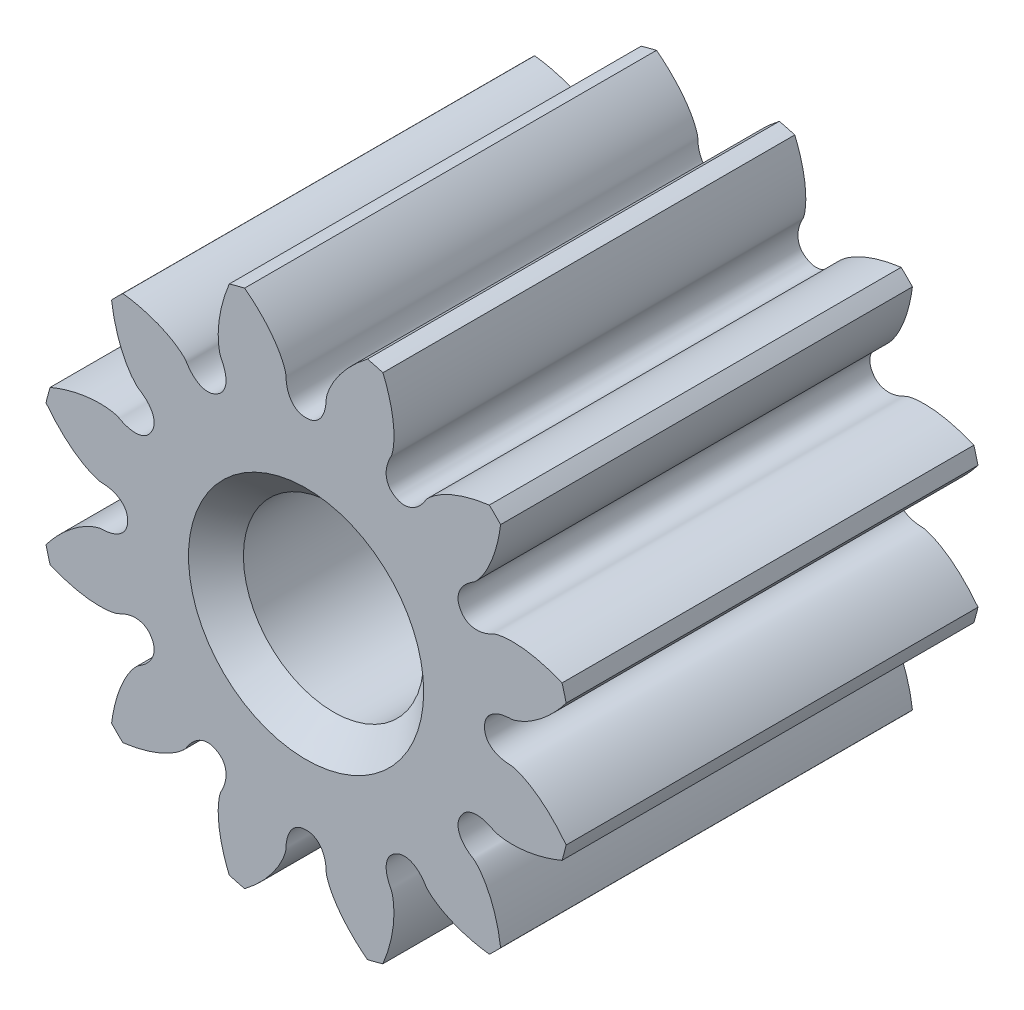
from build123d import *

# Parameters (mm, degrees)
BOSS_EXTRUDE1_DEPTH   = 4.5
F_1_CLEARANCE_HOLE1_D = 1.97
CHAMFER1_SIZE         = 0.3


with BuildPart() as part:
    # Sketch1 → Boss-Extrude1 (new body)
    with BuildSketch(Plane.XY.offset(2.25)):
        with BuildLine():
            ThreePointArc((2.841799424, 0.671249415), (2.82050337, 0.7557516), (2.796695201, 0.839580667))
            add(Edge.make_bspline(
                [(2.125445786, 2.002218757), (2.124398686, 1.994016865), (2.122450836, 1.979531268), (2.119419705, 1.958872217), (2.116496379, 1.940307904), (2.113419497, 1.922020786), (2.110194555, 1.904012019), (2.106827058, 1.886282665), (2.103322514, 1.868833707), (2.099686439, 1.85166604), (2.09592435, 1.834780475), (2.092041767, 1.818177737), (2.088044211, 1.801858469), (2.083937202, 1.785823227), (2.079726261, 1.770072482), (2.075416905, 1.754606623), (2.071014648, 1.739425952), (2.066524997, 1.724530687), (2.061953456, 1.709920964), (2.057305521, 1.695596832), (2.05258668, 1.681558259), (2.04780241, 1.667805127), (2.042958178, 1.654337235), (2.038059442, 1.641154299), (2.033111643, 1.628255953), (2.028120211, 1.615641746), (2.02309056, 1.603311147), (2.018028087, 1.591263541), (2.012938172, 1.579498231), (2.007826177, 1.568014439), (2.002697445, 1.556811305), (1.997557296, 1.545887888), (1.99241103, 1.535243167), (1.987263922, 1.52487604), (1.982121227, 1.514785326), (1.976988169, 1.504969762), (1.971869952, 1.49542801), (1.966771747, 1.486158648), (1.9616987, 1.477160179), (1.956655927, 1.468431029), (1.951648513, 1.459969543), (1.94668151, 1.451773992), (1.94175994, 1.44384257), (1.93688879, 1.436173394), (1.932073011, 1.428764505), (1.92731752, 1.421613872), (1.922627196, 1.414719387), (1.918006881, 1.408078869), (1.913461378, 1.401690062), (1.90899545, 1.395550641), (1.904613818, 1.389658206), (1.900321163, 1.384010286), (1.896122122, 1.378604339), (1.892021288, 1.373437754), (1.88802321, 1.368507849), (1.884132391, 1.363811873), (1.880353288, 1.359347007), (1.876690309, 1.355110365), (1.873147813, 1.351098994), (1.869730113, 1.347309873), (1.866441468, 1.343739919), (1.863286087, 1.340385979), (1.860268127, 1.337244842), (1.857391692, 1.334313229), (1.854660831, 1.3315878), (1.852079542, 1.329065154), (1.849651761, 1.32674183), (1.847381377, 1.324614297), (1.845272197, 1.322679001), (1.843328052, 1.320932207), (1.841552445, 1.319370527), (1.839949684, 1.317989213), (1.838521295, 1.316787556), (1.831879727, 1.31126094), (1.818888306, 1.304667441), (1.802313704, 1.293227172), (1.78696761, 1.282364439), (1.77244736, 1.271085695), (1.758655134, 1.259498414), (1.745606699, 1.247546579), (1.733290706, 1.235203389), (1.721707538, 1.222418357), (1.71086273, 1.209127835), (1.700774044, 1.195248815), (1.691477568, 1.180677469), (1.683037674, 1.165287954), (1.67556051, 1.148934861), (1.669211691, 1.131462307), (1.664236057, 1.112724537), (1.660976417, 1.09262513), (1.65987075, 1.071174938), (1.66144456, 1.04858005), (1.666136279, 1.025270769), (1.67390418, 1.003811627), (1.681956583, 0.987132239), (1.689162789, 0.975238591), (1.695859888, 0.963051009), (1.70627846, 0.94773773), (1.720978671, 0.93028096), (1.738819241, 0.914563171), (1.757600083, 0.901902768), (1.776729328, 0.892135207), (1.795765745, 0.884908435), (1.814480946, 0.879848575), (1.832787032, 0.876610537), (1.850687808, 0.874909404), (1.868235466, 0.874523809), (1.88550286, 0.87528912), (1.902566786, 0.877086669), (1.91949912, 0.879833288), (1.936362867, 0.883472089), (1.95321038, 0.887966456), (1.970085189, 0.893290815), (1.987016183, 0.899441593), (2.004043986, 0.906377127), (2.021124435, 0.914235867), (2.0393193, 0.922869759), (2.051525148, 0.930823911), (2.059632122, 0.933812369), (2.061386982, 0.934448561), (2.063384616, 0.935145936), (2.065624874, 0.935902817), (2.068109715, 0.936713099), (2.07084032, 0.937572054), (2.073818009, 0.938474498), (2.077043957, 0.939415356), (2.080519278, 0.940389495), (2.084244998, 0.941391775), (2.088222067, 0.942417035), (2.092451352, 0.943460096), (2.096933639, 0.944515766), (2.101669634, 0.945578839), (2.106659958, 0.946644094), (2.111905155, 0.9477063), (2.117405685, 0.948760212), (2.123161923, 0.949800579), (2.129174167, 0.950822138), (2.13544263, 0.951819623), (2.141967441, 0.952787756), (2.148748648, 0.953721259), (2.155786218, 0.954614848), (2.163080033, 0.955463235), (2.170629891, 0.956261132), (2.178435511, 0.95700325), (2.186496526, 0.9576843), (2.194812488, 0.958298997), (2.203382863, 0.958842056), (2.212207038, 0.959308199), (2.221284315, 0.959692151), (2.230613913, 0.959988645), (2.240194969, 0.96019242), (2.250026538, 0.960298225), (2.260107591, 0.960300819), (2.270437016, 0.960194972), (2.281013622, 0.959975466), (2.291836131, 0.959637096), (2.302903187, 0.959174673), (2.31421335, 0.958583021), (2.325765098, 0.957856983), (2.33755683, 0.95699142), (2.349586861, 0.955981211), (2.361853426, 0.954821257), (2.374354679, 0.953506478), (2.387088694, 0.952031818), (2.400053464, 0.950392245), (2.413246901, 0.948582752), (2.426666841, 0.946598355), (2.440311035, 0.944434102), (2.454177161, 0.942085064), (2.468262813, 0.939546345), (2.48256551, 0.936813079), (2.497082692, 0.933880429), (2.511811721, 0.930743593), (2.526749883, 0.927397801), (2.541894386, 0.923838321), (2.557242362, 0.920060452), (2.572790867, 0.916059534), (2.588536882, 0.911830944), (2.604477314, 0.907370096), (2.620608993, 0.902672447), (2.636928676, 0.897733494), (2.65343305, 0.892548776), (2.670118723, 0.887113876), (2.686982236, 0.881424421), (2.704020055, 0.875476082), (2.721228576, 0.86926458), (2.738604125, 0.862785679), (2.756142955, 0.856035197), (2.775549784, 0.848330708), (2.789068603, 0.842774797), (2.796695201, 0.839580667)],
                knots=[0.013980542, 0.013980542, 0.013980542, 0.013980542, 0.02423674, 0.032109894, 0.039880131, 0.047547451, 0.055111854, 0.062573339, 0.069931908, 0.07718756, 0.084340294, 0.091390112, 0.098337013, 0.105180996, 0.111922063, 0.118560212, 0.125095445, 0.13152776, 0.137857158, 0.144083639, 0.150207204, 0.156227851, 0.162145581, 0.167960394, 0.17367229, 0.179281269, 0.184787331, 0.190190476, 0.195490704, 0.200688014, 0.205782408, 0.210773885, 0.215662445, 0.220448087, 0.225130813, 0.229710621, 0.234187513, 0.238561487, 0.242832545, 0.247000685, 0.251065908, 0.255028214, 0.258887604, 0.262644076, 0.266297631, 0.269848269, 0.27329599, 0.276640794, 0.279882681, 0.283021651, 0.286057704, 0.28899084, 0.291821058, 0.29454836, 0.297172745, 0.299694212, 0.302112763, 0.304428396, 0.306641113, 0.308750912, 0.310757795, 0.31266176, 0.314462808, 0.31616094, 0.317756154, 0.319248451, 0.320637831, 0.321924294, 0.32310784, 0.324188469, 0.325166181, 0.326040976, 0.326812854, 0.327481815, 0.336753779, 0.344708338, 0.35247494, 0.360068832, 0.367507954, 0.37481349, 0.382010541, 0.38912891, 0.396204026, 0.403277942, 0.410400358, 0.417629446, 0.425032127, 0.432683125, 0.440661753, 0.449045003, 0.457895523, 0.467244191, 0.477070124, 0.487285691, 0.495470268, 0.5, 0.504529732, 0.512714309, 0.522929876, 0.532755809, 0.542104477, 0.550954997, 0.559338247, 0.567316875, 0.574967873, 0.582370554, 0.589599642, 0.596722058, 0.603795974, 0.61087109, 0.617989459, 0.62518651, 0.632492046, 0.639931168, 0.64752506, 0.655291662, 0.663246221, 0.672518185, 0.673187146, 0.673959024, 0.674833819, 0.675811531, 0.67689216, 0.678075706, 0.679362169, 0.680751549, 0.682243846, 0.68383906, 0.685537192, 0.68733824, 0.689242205, 0.691249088, 0.693358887, 0.695571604, 0.697887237, 0.700305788, 0.702827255, 0.70545164, 0.708178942, 0.71100916, 0.713942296, 0.716978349, 0.720117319, 0.723359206, 0.72670401, 0.730151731, 0.733702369, 0.737355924, 0.741112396, 0.744971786, 0.748934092, 0.752999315, 0.757167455, 0.761438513, 0.765812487, 0.770289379, 0.774869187, 0.779551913, 0.784337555, 0.789226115, 0.794217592, 0.799311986, 0.804509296, 0.809809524, 0.815212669, 0.820718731, 0.82632771, 0.832039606, 0.837854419, 0.843772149, 0.849792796, 0.855916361, 0.862142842, 0.86847224, 0.874904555, 0.881439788, 0.888077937, 0.894819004, 0.901662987, 0.908609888, 0.915659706, 0.92281244, 0.930068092, 0.937426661, 0.944888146, 0.952452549, 0.960119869, 0.967890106, 0.97576326, 0.986019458, 0.986019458, 0.986019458, 0.986019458], degree=3))
            ThreePointArc((2.125445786, 2.002218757), (2.06475177, 2.06475177), (2.002218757, 2.125445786))
            add(Edge.make_bspline(
                [(0.839580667, 2.796695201), (0.842774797, 2.789068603), (0.848330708, 2.775549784), (0.856035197, 2.756142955), (0.862785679, 2.738604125), (0.86926458, 2.721228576), (0.875476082, 2.704020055), (0.881424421, 2.686982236), (0.887113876, 2.670118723), (0.892548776, 2.65343305), (0.897733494, 2.636928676), (0.902672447, 2.620608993), (0.907370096, 2.604477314), (0.911830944, 2.588536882), (0.916059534, 2.572790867), (0.920060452, 2.557242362), (0.923838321, 2.541894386), (0.927397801, 2.526749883), (0.930743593, 2.511811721), (0.933880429, 2.497082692), (0.936813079, 2.48256551), (0.939546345, 2.468262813), (0.942085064, 2.454177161), (0.944434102, 2.440311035), (0.946598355, 2.426666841), (0.948582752, 2.413246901), (0.950392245, 2.400053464), (0.952031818, 2.387088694), (0.953506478, 2.374354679), (0.954821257, 2.361853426), (0.955981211, 2.349586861), (0.95699142, 2.33755683), (0.957856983, 2.325765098), (0.958583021, 2.31421335), (0.959174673, 2.302903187), (0.959637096, 2.291836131), (0.959975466, 2.281013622), (0.960194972, 2.270437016), (0.960300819, 2.260107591), (0.960298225, 2.250026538), (0.96019242, 2.240194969), (0.959988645, 2.230613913), (0.959692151, 2.221284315), (0.959308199, 2.212207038), (0.958842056, 2.203382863), (0.958298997, 2.194812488), (0.9576843, 2.186496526), (0.95700325, 2.178435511), (0.956261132, 2.170629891), (0.955463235, 2.163080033), (0.954614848, 2.155786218), (0.953721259, 2.148748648), (0.952787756, 2.141967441), (0.951819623, 2.13544263), (0.950822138, 2.129174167), (0.949800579, 2.123161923), (0.948760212, 2.117405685), (0.9477063, 2.111905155), (0.946644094, 2.106659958), (0.945578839, 2.101669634), (0.944515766, 2.096933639), (0.943460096, 2.092451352), (0.942417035, 2.088222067), (0.941391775, 2.084244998), (0.940389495, 2.080519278), (0.939415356, 2.077043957), (0.938474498, 2.073818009), (0.937572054, 2.07084032), (0.936713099, 2.068109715), (0.935902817, 2.065624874), (0.935145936, 2.063384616), (0.934448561, 2.061386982), (0.933812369, 2.059632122), (0.930823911, 2.051525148), (0.922869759, 2.0393193), (0.914235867, 2.021124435), (0.906377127, 2.004043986), (0.899441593, 1.987016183), (0.893290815, 1.970085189), (0.887966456, 1.95321038), (0.883472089, 1.936362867), (0.879833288, 1.91949912), (0.877086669, 1.902566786), (0.87528912, 1.88550286), (0.874523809, 1.868235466), (0.874909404, 1.850687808), (0.876610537, 1.832787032), (0.879848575, 1.814480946), (0.884908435, 1.795765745), (0.892135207, 1.776729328), (0.901902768, 1.757600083), (0.914563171, 1.738819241), (0.93028096, 1.720978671), (0.94773773, 1.70627846), (0.963051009, 1.695859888), (0.975238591, 1.689162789), (0.987132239, 1.681956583), (1.003811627, 1.67390418), (1.025270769, 1.666136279), (1.04858005, 1.66144456), (1.071174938, 1.65987075), (1.09262513, 1.660976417), (1.112724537, 1.664236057), (1.131462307, 1.669211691), (1.148934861, 1.67556051), (1.165287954, 1.683037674), (1.180677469, 1.691477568), (1.195248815, 1.700774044), (1.209127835, 1.71086273), (1.222418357, 1.721707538), (1.235203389, 1.733290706), (1.247546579, 1.745606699), (1.259498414, 1.758655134), (1.271085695, 1.77244736), (1.282364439, 1.78696761), (1.293227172, 1.802313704), (1.304667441, 1.818888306), (1.31126094, 1.831879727), (1.316787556, 1.838521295), (1.317989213, 1.839949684), (1.319370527, 1.841552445), (1.320932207, 1.843328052), (1.322679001, 1.845272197), (1.324614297, 1.847381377), (1.32674183, 1.849651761), (1.329065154, 1.852079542), (1.3315878, 1.854660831), (1.334313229, 1.857391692), (1.337244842, 1.860268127), (1.340385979, 1.863286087), (1.343739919, 1.866441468), (1.347309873, 1.869730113), (1.351098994, 1.873147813), (1.355110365, 1.876690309), (1.359347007, 1.880353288), (1.363811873, 1.884132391), (1.368507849, 1.88802321), (1.373437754, 1.892021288), (1.378604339, 1.896122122), (1.384010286, 1.900321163), (1.389658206, 1.904613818), (1.395550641, 1.90899545), (1.401690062, 1.913461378), (1.408078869, 1.918006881), (1.414719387, 1.922627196), (1.421613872, 1.92731752), (1.428764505, 1.932073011), (1.436173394, 1.93688879), (1.44384257, 1.94175994), (1.451773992, 1.94668151), (1.459969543, 1.951648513), (1.468431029, 1.956655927), (1.477160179, 1.9616987), (1.486158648, 1.966771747), (1.49542801, 1.971869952), (1.504969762, 1.976988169), (1.514785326, 1.982121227), (1.52487604, 1.987263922), (1.535243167, 1.99241103), (1.545887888, 1.997557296), (1.556811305, 2.002697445), (1.568014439, 2.007826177), (1.579498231, 2.012938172), (1.591263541, 2.018028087), (1.603311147, 2.02309056), (1.615641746, 2.028120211), (1.628255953, 2.033111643), (1.641154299, 2.038059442), (1.654337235, 2.042958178), (1.667805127, 2.04780241), (1.681558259, 2.05258668), (1.695596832, 2.057305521), (1.709920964, 2.061953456), (1.724530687, 2.066524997), (1.739425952, 2.071014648), (1.754606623, 2.075416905), (1.770072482, 2.079726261), (1.785823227, 2.083937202), (1.801858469, 2.088044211), (1.818177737, 2.092041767), (1.834780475, 2.09592435), (1.85166604, 2.099686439), (1.868833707, 2.103322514), (1.886282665, 2.106827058), (1.904012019, 2.110194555), (1.922020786, 2.113419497), (1.940307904, 2.116496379), (1.958872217, 2.119419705), (1.979531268, 2.122450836), (1.994016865, 2.124398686), (2.002218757, 2.125445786)],
                knots=[0.013980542, 0.013980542, 0.013980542, 0.013980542, 0.02423674, 0.032109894, 0.039880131, 0.047547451, 0.055111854, 0.062573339, 0.069931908, 0.07718756, 0.084340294, 0.091390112, 0.098337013, 0.105180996, 0.111922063, 0.118560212, 0.125095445, 0.13152776, 0.137857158, 0.144083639, 0.150207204, 0.156227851, 0.162145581, 0.167960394, 0.17367229, 0.179281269, 0.184787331, 0.190190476, 0.195490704, 0.200688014, 0.205782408, 0.210773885, 0.215662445, 0.220448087, 0.225130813, 0.229710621, 0.234187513, 0.238561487, 0.242832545, 0.247000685, 0.251065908, 0.255028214, 0.258887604, 0.262644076, 0.266297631, 0.269848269, 0.27329599, 0.276640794, 0.279882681, 0.283021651, 0.286057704, 0.28899084, 0.291821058, 0.29454836, 0.297172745, 0.299694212, 0.302112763, 0.304428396, 0.306641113, 0.308750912, 0.310757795, 0.31266176, 0.314462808, 0.31616094, 0.317756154, 0.319248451, 0.320637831, 0.321924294, 0.32310784, 0.324188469, 0.325166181, 0.326040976, 0.326812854, 0.327481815, 0.336753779, 0.344708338, 0.35247494, 0.360068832, 0.367507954, 0.37481349, 0.382010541, 0.38912891, 0.396204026, 0.403277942, 0.410400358, 0.417629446, 0.425032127, 0.432683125, 0.440661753, 0.449045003, 0.457895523, 0.467244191, 0.477070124, 0.487285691, 0.495470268, 0.5, 0.504529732, 0.512714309, 0.522929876, 0.532755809, 0.542104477, 0.550954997, 0.559338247, 0.567316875, 0.574967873, 0.582370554, 0.589599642, 0.596722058, 0.603795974, 0.61087109, 0.617989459, 0.62518651, 0.632492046, 0.639931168, 0.64752506, 0.655291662, 0.663246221, 0.672518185, 0.673187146, 0.673959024, 0.674833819, 0.675811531, 0.67689216, 0.678075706, 0.679362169, 0.680751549, 0.682243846, 0.68383906, 0.685537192, 0.68733824, 0.689242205, 0.691249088, 0.693358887, 0.695571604, 0.697887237, 0.700305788, 0.702827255, 0.70545164, 0.708178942, 0.71100916, 0.713942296, 0.716978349, 0.720117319, 0.723359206, 0.72670401, 0.730151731, 0.733702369, 0.737355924, 0.741112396, 0.744971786, 0.748934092, 0.752999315, 0.757167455, 0.761438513, 0.765812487, 0.770289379, 0.774869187, 0.779551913, 0.784337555, 0.789226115, 0.794217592, 0.799311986, 0.804509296, 0.809809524, 0.815212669, 0.820718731, 0.82632771, 0.832039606, 0.837854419, 0.843772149, 0.849792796, 0.855916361, 0.862142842, 0.86847224, 0.874904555, 0.881439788, 0.888077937, 0.894819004, 0.901662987, 0.908609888, 0.915659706, 0.92281244, 0.930068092, 0.937426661, 0.944888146, 0.952452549, 0.960119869, 0.967890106, 0.97576326, 0.986019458, 0.986019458, 0.986019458, 0.986019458], degree=3))
            ThreePointArc((0.839580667, 2.796695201), (0.7557516, 2.82050337), (0.671249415, 2.841799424))
            add(Edge.make_bspline(
                [(-0.671249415, 2.841799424), (-0.664669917, 2.836791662), (-0.653098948, 2.827861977), (-0.63672325, 2.814907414), (-0.622107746, 2.803093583), (-0.607809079, 2.791285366), (-0.5938255, 2.779488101), (-0.580155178, 2.767707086), (-0.566796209, 2.755947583), (-0.553746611, 2.744214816), (-0.541004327, 2.732513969), (-0.528567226, 2.720850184), (-0.516433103, 2.709228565), (-0.50459968, 2.69765417), (-0.493064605, 2.686132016), (-0.481825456, 2.674667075), (-0.470879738, 2.663264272), (-0.460224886, 2.651928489), (-0.449858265, 2.640664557), (-0.439777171, 2.629477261), (-0.42997883, 2.618371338), (-0.420460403, 2.607351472), (-0.411218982, 2.596422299), (-0.402251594, 2.585588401), (-0.393555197, 2.574854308), (-0.38512669, 2.564224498), (-0.376962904, 2.553703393), (-0.369060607, 2.543295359), (-0.361416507, 2.533004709), (-0.354027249, 2.522835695), (-0.346889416, 2.512792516), (-0.339999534, 2.502879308), (-0.333354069, 2.49310015), (-0.326949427, 2.483459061), (-0.32078196, 2.473959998), (-0.314847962, 2.464606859), (-0.30914367, 2.455403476), (-0.303665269, 2.44635362), (-0.298408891, 2.437460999), (-0.293370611, 2.428729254), (-0.288546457, 2.420161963), (-0.283932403, 2.411762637), (-0.279524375, 2.403534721), (-0.275318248, 2.395481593), (-0.271309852, 2.387606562), (-0.267494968, 2.379912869), (-0.26386933, 2.372403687), (-0.26042863, 2.365082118), (-0.257168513, 2.357951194), (-0.254084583, 2.351013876), (-0.2511724, 2.344273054), (-0.248427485, 2.337731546), (-0.245845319, 2.331392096), (-0.243421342, 2.325257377), (-0.241150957, 2.319329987), (-0.239029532, 2.313612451), (-0.237052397, 2.308107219), (-0.235214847, 2.302816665), (-0.233512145, 2.297743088), (-0.231939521, 2.292888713), (-0.230492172, 2.288255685), (-0.229165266, 2.283846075), (-0.227953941, 2.279661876), (-0.226853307, 2.275705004), (-0.225858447, 2.271977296), (-0.224964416, 2.26848051), (-0.224166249, 2.265216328), (-0.223458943, 2.262186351), (-0.222837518, 2.2593921), (-0.222296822, 2.256835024), (-0.221832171, 2.254516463), (-0.221437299, 2.252437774), (-0.221110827, 2.250599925), (-0.219645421, 2.24208485), (-0.220430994, 2.2275372), (-0.218810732, 2.207463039), (-0.217076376, 2.188741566), (-0.214568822, 2.170527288), (-0.211430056, 2.152789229), (-0.207603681, 2.135513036), (-0.203072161, 2.118675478), (-0.197791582, 2.102251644), (-0.191704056, 2.086214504), (-0.184728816, 2.070537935), (-0.176757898, 2.055201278), (-0.167650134, 2.040197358), (-0.157226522, 2.025545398), (-0.145269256, 2.011310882), (-0.131529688, 1.997632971), (-0.115752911, 1.984760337), (-0.097729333, 1.973077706), (-0.077374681, 1.963143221), (-0.054842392, 1.955551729), (-0.03237428, 1.951549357), (-0.013903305, 1.950183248), (0, 1.950477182), (0.013903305, 1.950183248), (0.03237428, 1.951549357), (0.054842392, 1.955551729), (0.077374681, 1.963143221), (0.097729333, 1.973077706), (0.115752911, 1.984760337), (0.131529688, 1.997632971), (0.145269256, 2.011310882), (0.157226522, 2.025545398), (0.167650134, 2.040197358), (0.176757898, 2.055201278), (0.184728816, 2.070537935), (0.191704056, 2.086214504), (0.197791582, 2.102251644), (0.203072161, 2.118675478), (0.207603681, 2.135513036), (0.211430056, 2.152789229), (0.214568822, 2.170527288), (0.217076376, 2.188741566), (0.218810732, 2.207463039), (0.220430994, 2.2275372), (0.219645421, 2.24208485), (0.221110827, 2.250599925), (0.221437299, 2.252437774), (0.221832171, 2.254516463), (0.222296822, 2.256835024), (0.222837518, 2.2593921), (0.223458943, 2.262186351), (0.224166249, 2.265216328), (0.224964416, 2.26848051), (0.225858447, 2.271977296), (0.226853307, 2.275705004), (0.227953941, 2.279661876), (0.229165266, 2.283846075), (0.230492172, 2.288255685), (0.231939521, 2.292888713), (0.233512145, 2.297743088), (0.235214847, 2.302816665), (0.237052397, 2.308107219), (0.239029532, 2.313612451), (0.241150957, 2.319329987), (0.243421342, 2.325257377), (0.245845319, 2.331392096), (0.248427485, 2.337731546), (0.2511724, 2.344273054), (0.254084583, 2.351013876), (0.257168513, 2.357951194), (0.26042863, 2.365082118), (0.26386933, 2.372403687), (0.267494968, 2.379912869), (0.271309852, 2.387606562), (0.275318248, 2.395481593), (0.279524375, 2.403534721), (0.283932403, 2.411762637), (0.288546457, 2.420161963), (0.293370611, 2.428729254), (0.298408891, 2.437460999), (0.303665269, 2.44635362), (0.30914367, 2.455403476), (0.314847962, 2.464606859), (0.32078196, 2.473959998), (0.326949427, 2.483459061), (0.333354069, 2.49310015), (0.339999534, 2.502879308), (0.346889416, 2.512792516), (0.354027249, 2.522835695), (0.361416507, 2.533004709), (0.369060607, 2.543295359), (0.376962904, 2.553703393), (0.38512669, 2.564224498), (0.393555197, 2.574854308), (0.402251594, 2.585588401), (0.411218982, 2.596422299), (0.420460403, 2.607351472), (0.42997883, 2.618371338), (0.439777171, 2.629477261), (0.449858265, 2.640664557), (0.460224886, 2.651928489), (0.470879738, 2.663264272), (0.481825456, 2.674667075), (0.493064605, 2.686132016), (0.50459968, 2.69765417), (0.516433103, 2.709228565), (0.528567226, 2.720850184), (0.541004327, 2.732513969), (0.553746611, 2.744214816), (0.566796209, 2.755947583), (0.580155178, 2.767707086), (0.5938255, 2.779488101), (0.607809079, 2.791285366), (0.622107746, 2.803093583), (0.63672325, 2.814907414), (0.653098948, 2.827861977), (0.664669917, 2.836791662), (0.671249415, 2.841799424)],
                knots=[0.013980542, 0.013980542, 0.013980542, 0.013980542, 0.02423674, 0.032109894, 0.039880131, 0.047547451, 0.055111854, 0.062573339, 0.069931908, 0.07718756, 0.084340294, 0.091390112, 0.098337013, 0.105180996, 0.111922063, 0.118560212, 0.125095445, 0.13152776, 0.137857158, 0.144083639, 0.150207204, 0.156227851, 0.162145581, 0.167960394, 0.17367229, 0.179281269, 0.184787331, 0.190190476, 0.195490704, 0.200688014, 0.205782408, 0.210773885, 0.215662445, 0.220448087, 0.225130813, 0.229710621, 0.234187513, 0.238561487, 0.242832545, 0.247000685, 0.251065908, 0.255028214, 0.258887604, 0.262644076, 0.266297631, 0.269848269, 0.27329599, 0.276640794, 0.279882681, 0.283021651, 0.286057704, 0.28899084, 0.291821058, 0.29454836, 0.297172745, 0.299694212, 0.302112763, 0.304428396, 0.306641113, 0.308750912, 0.310757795, 0.31266176, 0.314462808, 0.31616094, 0.317756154, 0.319248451, 0.320637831, 0.321924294, 0.32310784, 0.324188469, 0.325166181, 0.326040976, 0.326812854, 0.327481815, 0.336753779, 0.344708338, 0.35247494, 0.360068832, 0.367507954, 0.37481349, 0.382010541, 0.38912891, 0.396204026, 0.403277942, 0.410400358, 0.417629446, 0.425032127, 0.432683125, 0.440661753, 0.449045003, 0.457895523, 0.467244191, 0.477070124, 0.487285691, 0.495470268, 0.5, 0.504529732, 0.512714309, 0.522929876, 0.532755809, 0.542104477, 0.550954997, 0.559338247, 0.567316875, 0.574967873, 0.582370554, 0.589599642, 0.596722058, 0.603795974, 0.61087109, 0.617989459, 0.62518651, 0.632492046, 0.639931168, 0.64752506, 0.655291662, 0.663246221, 0.672518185, 0.673187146, 0.673959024, 0.674833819, 0.675811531, 0.67689216, 0.678075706, 0.679362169, 0.680751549, 0.682243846, 0.68383906, 0.685537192, 0.68733824, 0.689242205, 0.691249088, 0.693358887, 0.695571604, 0.697887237, 0.700305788, 0.702827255, 0.70545164, 0.708178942, 0.71100916, 0.713942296, 0.716978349, 0.720117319, 0.723359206, 0.72670401, 0.730151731, 0.733702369, 0.737355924, 0.741112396, 0.744971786, 0.748934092, 0.752999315, 0.757167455, 0.761438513, 0.765812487, 0.770289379, 0.774869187, 0.779551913, 0.784337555, 0.789226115, 0.794217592, 0.799311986, 0.804509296, 0.809809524, 0.815212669, 0.820718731, 0.82632771, 0.832039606, 0.837854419, 0.843772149, 0.849792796, 0.855916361, 0.862142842, 0.86847224, 0.874904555, 0.881439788, 0.888077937, 0.894819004, 0.901662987, 0.908609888, 0.915659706, 0.92281244, 0.930068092, 0.937426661, 0.944888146, 0.952452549, 0.960119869, 0.967890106, 0.97576326, 0.986019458, 0.986019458, 0.986019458, 0.986019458], degree=3))
            ThreePointArc((-0.671249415, 2.841799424), (-0.7557516, 2.82050337), (-0.839580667, 2.796695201))
            add(Edge.make_bspline(
                [(-2.002218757, 2.125445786), (-1.994016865, 2.124398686), (-1.979531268, 2.122450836), (-1.958872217, 2.119419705), (-1.940307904, 2.116496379), (-1.922020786, 2.113419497), (-1.904012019, 2.110194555), (-1.886282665, 2.106827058), (-1.868833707, 2.103322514), (-1.85166604, 2.099686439), (-1.834780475, 2.09592435), (-1.818177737, 2.092041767), (-1.801858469, 2.088044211), (-1.785823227, 2.083937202), (-1.770072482, 2.079726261), (-1.754606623, 2.075416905), (-1.739425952, 2.071014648), (-1.724530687, 2.066524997), (-1.709920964, 2.061953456), (-1.695596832, 2.057305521), (-1.681558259, 2.05258668), (-1.667805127, 2.04780241), (-1.654337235, 2.042958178), (-1.641154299, 2.038059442), (-1.628255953, 2.033111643), (-1.615641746, 2.028120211), (-1.603311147, 2.02309056), (-1.591263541, 2.018028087), (-1.579498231, 2.012938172), (-1.568014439, 2.007826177), (-1.556811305, 2.002697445), (-1.545887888, 1.997557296), (-1.535243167, 1.99241103), (-1.52487604, 1.987263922), (-1.514785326, 1.982121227), (-1.504969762, 1.976988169), (-1.49542801, 1.971869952), (-1.486158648, 1.966771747), (-1.477160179, 1.9616987), (-1.468431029, 1.956655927), (-1.459969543, 1.951648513), (-1.451773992, 1.94668151), (-1.44384257, 1.94175994), (-1.436173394, 1.93688879), (-1.428764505, 1.932073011), (-1.421613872, 1.92731752), (-1.414719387, 1.922627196), (-1.408078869, 1.918006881), (-1.401690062, 1.913461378), (-1.395550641, 1.90899545), (-1.389658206, 1.904613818), (-1.384010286, 1.900321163), (-1.378604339, 1.896122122), (-1.373437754, 1.892021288), (-1.368507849, 1.88802321), (-1.363811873, 1.884132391), (-1.359347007, 1.880353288), (-1.355110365, 1.876690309), (-1.351098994, 1.873147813), (-1.347309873, 1.869730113), (-1.343739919, 1.866441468), (-1.340385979, 1.863286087), (-1.337244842, 1.860268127), (-1.334313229, 1.857391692), (-1.3315878, 1.854660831), (-1.329065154, 1.852079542), (-1.32674183, 1.849651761), (-1.324614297, 1.847381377), (-1.322679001, 1.845272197), (-1.320932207, 1.843328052), (-1.319370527, 1.841552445), (-1.317989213, 1.839949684), (-1.316787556, 1.838521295), (-1.31126094, 1.831879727), (-1.304667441, 1.818888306), (-1.293227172, 1.802313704), (-1.282364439, 1.78696761), (-1.271085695, 1.77244736), (-1.259498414, 1.758655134), (-1.247546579, 1.745606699), (-1.235203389, 1.733290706), (-1.222418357, 1.721707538), (-1.209127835, 1.71086273), (-1.195248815, 1.700774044), (-1.180677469, 1.691477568), (-1.165287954, 1.683037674), (-1.148934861, 1.67556051), (-1.131462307, 1.669211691), (-1.112724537, 1.664236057), (-1.09262513, 1.660976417), (-1.071174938, 1.65987075), (-1.04858005, 1.66144456), (-1.025270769, 1.666136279), (-1.003811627, 1.67390418), (-0.987132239, 1.681956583), (-0.975238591, 1.689162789), (-0.963051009, 1.695859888), (-0.94773773, 1.70627846), (-0.93028096, 1.720978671), (-0.914563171, 1.738819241), (-0.901902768, 1.757600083), (-0.892135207, 1.776729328), (-0.884908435, 1.795765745), (-0.879848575, 1.814480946), (-0.876610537, 1.832787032), (-0.874909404, 1.850687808), (-0.874523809, 1.868235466), (-0.87528912, 1.88550286), (-0.877086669, 1.902566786), (-0.879833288, 1.91949912), (-0.883472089, 1.936362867), (-0.887966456, 1.95321038), (-0.893290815, 1.970085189), (-0.899441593, 1.987016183), (-0.906377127, 2.004043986), (-0.914235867, 2.021124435), (-0.922869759, 2.0393193), (-0.930823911, 2.051525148), (-0.933812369, 2.059632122), (-0.934448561, 2.061386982), (-0.935145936, 2.063384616), (-0.935902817, 2.065624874), (-0.936713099, 2.068109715), (-0.937572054, 2.07084032), (-0.938474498, 2.073818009), (-0.939415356, 2.077043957), (-0.940389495, 2.080519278), (-0.941391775, 2.084244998), (-0.942417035, 2.088222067), (-0.943460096, 2.092451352), (-0.944515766, 2.096933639), (-0.945578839, 2.101669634), (-0.946644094, 2.106659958), (-0.9477063, 2.111905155), (-0.948760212, 2.117405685), (-0.949800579, 2.123161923), (-0.950822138, 2.129174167), (-0.951819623, 2.13544263), (-0.952787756, 2.141967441), (-0.953721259, 2.148748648), (-0.954614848, 2.155786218), (-0.955463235, 2.163080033), (-0.956261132, 2.170629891), (-0.95700325, 2.178435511), (-0.9576843, 2.186496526), (-0.958298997, 2.194812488), (-0.958842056, 2.203382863), (-0.959308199, 2.212207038), (-0.959692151, 2.221284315), (-0.959988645, 2.230613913), (-0.96019242, 2.240194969), (-0.960298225, 2.250026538), (-0.960300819, 2.260107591), (-0.960194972, 2.270437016), (-0.959975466, 2.281013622), (-0.959637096, 2.291836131), (-0.959174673, 2.302903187), (-0.958583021, 2.31421335), (-0.957856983, 2.325765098), (-0.95699142, 2.33755683), (-0.955981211, 2.349586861), (-0.954821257, 2.361853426), (-0.953506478, 2.374354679), (-0.952031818, 2.387088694), (-0.950392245, 2.400053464), (-0.948582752, 2.413246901), (-0.946598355, 2.426666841), (-0.944434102, 2.440311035), (-0.942085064, 2.454177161), (-0.939546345, 2.468262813), (-0.936813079, 2.48256551), (-0.933880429, 2.497082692), (-0.930743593, 2.511811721), (-0.927397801, 2.526749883), (-0.923838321, 2.541894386), (-0.920060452, 2.557242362), (-0.916059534, 2.572790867), (-0.911830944, 2.588536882), (-0.907370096, 2.604477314), (-0.902672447, 2.620608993), (-0.897733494, 2.636928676), (-0.892548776, 2.65343305), (-0.887113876, 2.670118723), (-0.881424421, 2.686982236), (-0.875476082, 2.704020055), (-0.86926458, 2.721228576), (-0.862785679, 2.738604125), (-0.856035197, 2.756142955), (-0.848330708, 2.775549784), (-0.842774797, 2.789068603), (-0.839580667, 2.796695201)],
                knots=[0.013980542, 0.013980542, 0.013980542, 0.013980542, 0.02423674, 0.032109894, 0.039880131, 0.047547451, 0.055111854, 0.062573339, 0.069931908, 0.07718756, 0.084340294, 0.091390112, 0.098337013, 0.105180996, 0.111922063, 0.118560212, 0.125095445, 0.13152776, 0.137857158, 0.144083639, 0.150207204, 0.156227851, 0.162145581, 0.167960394, 0.17367229, 0.179281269, 0.184787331, 0.190190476, 0.195490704, 0.200688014, 0.205782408, 0.210773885, 0.215662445, 0.220448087, 0.225130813, 0.229710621, 0.234187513, 0.238561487, 0.242832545, 0.247000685, 0.251065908, 0.255028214, 0.258887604, 0.262644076, 0.266297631, 0.269848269, 0.27329599, 0.276640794, 0.279882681, 0.283021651, 0.286057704, 0.28899084, 0.291821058, 0.29454836, 0.297172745, 0.299694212, 0.302112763, 0.304428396, 0.306641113, 0.308750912, 0.310757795, 0.31266176, 0.314462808, 0.31616094, 0.317756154, 0.319248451, 0.320637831, 0.321924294, 0.32310784, 0.324188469, 0.325166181, 0.326040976, 0.326812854, 0.327481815, 0.336753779, 0.344708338, 0.35247494, 0.360068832, 0.367507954, 0.37481349, 0.382010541, 0.38912891, 0.396204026, 0.403277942, 0.410400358, 0.417629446, 0.425032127, 0.432683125, 0.440661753, 0.449045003, 0.457895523, 0.467244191, 0.477070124, 0.487285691, 0.495470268, 0.5, 0.504529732, 0.512714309, 0.522929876, 0.532755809, 0.542104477, 0.550954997, 0.559338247, 0.567316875, 0.574967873, 0.582370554, 0.589599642, 0.596722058, 0.603795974, 0.61087109, 0.617989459, 0.62518651, 0.632492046, 0.639931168, 0.64752506, 0.655291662, 0.663246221, 0.672518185, 0.673187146, 0.673959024, 0.674833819, 0.675811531, 0.67689216, 0.678075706, 0.679362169, 0.680751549, 0.682243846, 0.68383906, 0.685537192, 0.68733824, 0.689242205, 0.691249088, 0.693358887, 0.695571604, 0.697887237, 0.700305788, 0.702827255, 0.70545164, 0.708178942, 0.71100916, 0.713942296, 0.716978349, 0.720117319, 0.723359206, 0.72670401, 0.730151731, 0.733702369, 0.737355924, 0.741112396, 0.744971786, 0.748934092, 0.752999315, 0.757167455, 0.761438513, 0.765812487, 0.770289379, 0.774869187, 0.779551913, 0.784337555, 0.789226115, 0.794217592, 0.799311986, 0.804509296, 0.809809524, 0.815212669, 0.820718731, 0.82632771, 0.832039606, 0.837854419, 0.843772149, 0.849792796, 0.855916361, 0.862142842, 0.86847224, 0.874904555, 0.881439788, 0.888077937, 0.894819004, 0.901662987, 0.908609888, 0.915659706, 0.92281244, 0.930068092, 0.937426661, 0.944888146, 0.952452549, 0.960119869, 0.967890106, 0.97576326, 0.986019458, 0.986019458, 0.986019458, 0.986019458], degree=3))
            ThreePointArc((-2.002218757, 2.125445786), (-2.06475177, 2.06475177), (-2.125445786, 2.002218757))
            add(Edge.make_bspline(
                [(-2.796695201, 0.839580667), (-2.789068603, 0.842774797), (-2.775549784, 0.848330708), (-2.756142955, 0.856035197), (-2.738604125, 0.862785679), (-2.721228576, 0.86926458), (-2.704020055, 0.875476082), (-2.686982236, 0.881424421), (-2.670118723, 0.887113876), (-2.65343305, 0.892548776), (-2.636928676, 0.897733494), (-2.620608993, 0.902672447), (-2.604477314, 0.907370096), (-2.588536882, 0.911830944), (-2.572790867, 0.916059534), (-2.557242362, 0.920060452), (-2.541894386, 0.923838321), (-2.526749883, 0.927397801), (-2.511811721, 0.930743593), (-2.497082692, 0.933880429), (-2.48256551, 0.936813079), (-2.468262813, 0.939546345), (-2.454177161, 0.942085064), (-2.440311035, 0.944434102), (-2.426666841, 0.946598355), (-2.413246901, 0.948582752), (-2.400053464, 0.950392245), (-2.387088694, 0.952031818), (-2.374354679, 0.953506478), (-2.361853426, 0.954821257), (-2.349586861, 0.955981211), (-2.33755683, 0.95699142), (-2.325765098, 0.957856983), (-2.31421335, 0.958583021), (-2.302903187, 0.959174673), (-2.291836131, 0.959637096), (-2.281013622, 0.959975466), (-2.270437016, 0.960194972), (-2.260107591, 0.960300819), (-2.250026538, 0.960298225), (-2.240194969, 0.96019242), (-2.230613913, 0.959988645), (-2.221284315, 0.959692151), (-2.212207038, 0.959308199), (-2.203382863, 0.958842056), (-2.194812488, 0.958298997), (-2.186496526, 0.9576843), (-2.178435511, 0.95700325), (-2.170629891, 0.956261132), (-2.163080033, 0.955463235), (-2.155786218, 0.954614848), (-2.148748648, 0.953721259), (-2.141967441, 0.952787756), (-2.13544263, 0.951819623), (-2.129174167, 0.950822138), (-2.123161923, 0.949800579), (-2.117405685, 0.948760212), (-2.111905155, 0.9477063), (-2.106659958, 0.946644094), (-2.101669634, 0.945578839), (-2.096933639, 0.944515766), (-2.092451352, 0.943460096), (-2.088222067, 0.942417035), (-2.084244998, 0.941391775), (-2.080519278, 0.940389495), (-2.077043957, 0.939415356), (-2.073818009, 0.938474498), (-2.07084032, 0.937572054), (-2.068109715, 0.936713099), (-2.065624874, 0.935902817), (-2.063384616, 0.935145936), (-2.061386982, 0.934448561), (-2.059632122, 0.933812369), (-2.051525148, 0.930823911), (-2.0393193, 0.922869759), (-2.021124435, 0.914235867), (-2.004043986, 0.906377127), (-1.987016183, 0.899441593), (-1.970085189, 0.893290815), (-1.95321038, 0.887966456), (-1.936362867, 0.883472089), (-1.91949912, 0.879833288), (-1.902566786, 0.877086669), (-1.88550286, 0.87528912), (-1.868235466, 0.874523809), (-1.850687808, 0.874909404), (-1.832787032, 0.876610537), (-1.814480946, 0.879848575), (-1.795765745, 0.884908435), (-1.776729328, 0.892135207), (-1.757600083, 0.901902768), (-1.738819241, 0.914563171), (-1.720978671, 0.93028096), (-1.70627846, 0.94773773), (-1.695859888, 0.963051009), (-1.689162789, 0.975238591), (-1.681956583, 0.987132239), (-1.67390418, 1.003811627), (-1.666136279, 1.025270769), (-1.66144456, 1.04858005), (-1.65987075, 1.071174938), (-1.660976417, 1.09262513), (-1.664236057, 1.112724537), (-1.669211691, 1.131462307), (-1.67556051, 1.148934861), (-1.683037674, 1.165287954), (-1.691477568, 1.180677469), (-1.700774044, 1.195248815), (-1.71086273, 1.209127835), (-1.721707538, 1.222418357), (-1.733290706, 1.235203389), (-1.745606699, 1.247546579), (-1.758655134, 1.259498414), (-1.77244736, 1.271085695), (-1.78696761, 1.282364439), (-1.802313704, 1.293227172), (-1.818888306, 1.304667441), (-1.831879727, 1.31126094), (-1.838521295, 1.316787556), (-1.839949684, 1.317989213), (-1.841552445, 1.319370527), (-1.843328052, 1.320932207), (-1.845272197, 1.322679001), (-1.847381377, 1.324614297), (-1.849651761, 1.32674183), (-1.852079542, 1.329065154), (-1.854660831, 1.3315878), (-1.857391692, 1.334313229), (-1.860268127, 1.337244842), (-1.863286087, 1.340385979), (-1.866441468, 1.343739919), (-1.869730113, 1.347309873), (-1.873147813, 1.351098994), (-1.876690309, 1.355110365), (-1.880353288, 1.359347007), (-1.884132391, 1.363811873), (-1.88802321, 1.368507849), (-1.892021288, 1.373437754), (-1.896122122, 1.378604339), (-1.900321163, 1.384010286), (-1.904613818, 1.389658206), (-1.90899545, 1.395550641), (-1.913461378, 1.401690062), (-1.918006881, 1.408078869), (-1.922627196, 1.414719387), (-1.92731752, 1.421613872), (-1.932073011, 1.428764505), (-1.93688879, 1.436173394), (-1.94175994, 1.44384257), (-1.94668151, 1.451773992), (-1.951648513, 1.459969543), (-1.956655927, 1.468431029), (-1.9616987, 1.477160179), (-1.966771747, 1.486158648), (-1.971869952, 1.49542801), (-1.976988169, 1.504969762), (-1.982121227, 1.514785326), (-1.987263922, 1.52487604), (-1.99241103, 1.535243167), (-1.997557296, 1.545887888), (-2.002697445, 1.556811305), (-2.007826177, 1.568014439), (-2.012938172, 1.579498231), (-2.018028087, 1.591263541), (-2.02309056, 1.603311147), (-2.028120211, 1.615641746), (-2.033111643, 1.628255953), (-2.038059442, 1.641154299), (-2.042958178, 1.654337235), (-2.04780241, 1.667805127), (-2.05258668, 1.681558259), (-2.057305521, 1.695596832), (-2.061953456, 1.709920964), (-2.066524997, 1.724530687), (-2.071014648, 1.739425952), (-2.075416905, 1.754606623), (-2.079726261, 1.770072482), (-2.083937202, 1.785823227), (-2.088044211, 1.801858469), (-2.092041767, 1.818177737), (-2.09592435, 1.834780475), (-2.099686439, 1.85166604), (-2.103322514, 1.868833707), (-2.106827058, 1.886282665), (-2.110194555, 1.904012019), (-2.113419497, 1.922020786), (-2.116496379, 1.940307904), (-2.119419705, 1.958872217), (-2.122450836, 1.979531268), (-2.124398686, 1.994016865), (-2.125445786, 2.002218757)],
                knots=[0.013980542, 0.013980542, 0.013980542, 0.013980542, 0.02423674, 0.032109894, 0.039880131, 0.047547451, 0.055111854, 0.062573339, 0.069931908, 0.07718756, 0.084340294, 0.091390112, 0.098337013, 0.105180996, 0.111922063, 0.118560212, 0.125095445, 0.13152776, 0.137857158, 0.144083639, 0.150207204, 0.156227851, 0.162145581, 0.167960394, 0.17367229, 0.179281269, 0.184787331, 0.190190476, 0.195490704, 0.200688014, 0.205782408, 0.210773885, 0.215662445, 0.220448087, 0.225130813, 0.229710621, 0.234187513, 0.238561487, 0.242832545, 0.247000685, 0.251065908, 0.255028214, 0.258887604, 0.262644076, 0.266297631, 0.269848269, 0.27329599, 0.276640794, 0.279882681, 0.283021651, 0.286057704, 0.28899084, 0.291821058, 0.29454836, 0.297172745, 0.299694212, 0.302112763, 0.304428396, 0.306641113, 0.308750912, 0.310757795, 0.31266176, 0.314462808, 0.31616094, 0.317756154, 0.319248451, 0.320637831, 0.321924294, 0.32310784, 0.324188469, 0.325166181, 0.326040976, 0.326812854, 0.327481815, 0.336753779, 0.344708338, 0.35247494, 0.360068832, 0.367507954, 0.37481349, 0.382010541, 0.38912891, 0.396204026, 0.403277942, 0.410400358, 0.417629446, 0.425032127, 0.432683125, 0.440661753, 0.449045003, 0.457895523, 0.467244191, 0.477070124, 0.487285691, 0.495470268, 0.5, 0.504529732, 0.512714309, 0.522929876, 0.532755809, 0.542104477, 0.550954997, 0.559338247, 0.567316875, 0.574967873, 0.582370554, 0.589599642, 0.596722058, 0.603795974, 0.61087109, 0.617989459, 0.62518651, 0.632492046, 0.639931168, 0.64752506, 0.655291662, 0.663246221, 0.672518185, 0.673187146, 0.673959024, 0.674833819, 0.675811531, 0.67689216, 0.678075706, 0.679362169, 0.680751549, 0.682243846, 0.68383906, 0.685537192, 0.68733824, 0.689242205, 0.691249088, 0.693358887, 0.695571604, 0.697887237, 0.700305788, 0.702827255, 0.70545164, 0.708178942, 0.71100916, 0.713942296, 0.716978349, 0.720117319, 0.723359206, 0.72670401, 0.730151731, 0.733702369, 0.737355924, 0.741112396, 0.744971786, 0.748934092, 0.752999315, 0.757167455, 0.761438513, 0.765812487, 0.770289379, 0.774869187, 0.779551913, 0.784337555, 0.789226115, 0.794217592, 0.799311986, 0.804509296, 0.809809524, 0.815212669, 0.820718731, 0.82632771, 0.832039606, 0.837854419, 0.843772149, 0.849792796, 0.855916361, 0.862142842, 0.86847224, 0.874904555, 0.881439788, 0.888077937, 0.894819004, 0.901662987, 0.908609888, 0.915659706, 0.92281244, 0.930068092, 0.937426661, 0.944888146, 0.952452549, 0.960119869, 0.967890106, 0.97576326, 0.986019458, 0.986019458, 0.986019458, 0.986019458], degree=3))
            ThreePointArc((-2.796695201, 0.839580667), (-2.82050337, 0.7557516), (-2.841799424, 0.671249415))
            add(Edge.make_bspline(
                [(-2.841799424, -0.671249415), (-2.836791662, -0.664669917), (-2.827861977, -0.653098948), (-2.814907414, -0.63672325), (-2.803093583, -0.622107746), (-2.791285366, -0.607809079), (-2.779488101, -0.5938255), (-2.767707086, -0.580155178), (-2.755947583, -0.566796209), (-2.744214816, -0.553746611), (-2.732513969, -0.541004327), (-2.720850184, -0.528567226), (-2.709228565, -0.516433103), (-2.69765417, -0.50459968), (-2.686132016, -0.493064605), (-2.674667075, -0.481825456), (-2.663264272, -0.470879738), (-2.651928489, -0.460224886), (-2.640664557, -0.449858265), (-2.629477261, -0.439777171), (-2.618371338, -0.42997883), (-2.607351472, -0.420460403), (-2.596422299, -0.411218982), (-2.585588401, -0.402251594), (-2.574854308, -0.393555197), (-2.564224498, -0.38512669), (-2.553703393, -0.376962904), (-2.543295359, -0.369060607), (-2.533004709, -0.361416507), (-2.522835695, -0.354027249), (-2.512792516, -0.346889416), (-2.502879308, -0.339999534), (-2.49310015, -0.333354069), (-2.483459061, -0.326949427), (-2.473959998, -0.32078196), (-2.464606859, -0.314847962), (-2.455403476, -0.30914367), (-2.44635362, -0.303665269), (-2.437460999, -0.298408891), (-2.428729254, -0.293370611), (-2.420161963, -0.288546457), (-2.411762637, -0.283932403), (-2.403534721, -0.279524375), (-2.395481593, -0.275318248), (-2.387606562, -0.271309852), (-2.379912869, -0.267494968), (-2.372403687, -0.26386933), (-2.365082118, -0.26042863), (-2.357951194, -0.257168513), (-2.351013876, -0.254084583), (-2.344273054, -0.2511724), (-2.337731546, -0.248427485), (-2.331392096, -0.245845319), (-2.325257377, -0.243421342), (-2.319329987, -0.241150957), (-2.313612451, -0.239029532), (-2.308107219, -0.237052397), (-2.302816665, -0.235214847), (-2.297743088, -0.233512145), (-2.292888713, -0.231939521), (-2.288255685, -0.230492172), (-2.283846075, -0.229165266), (-2.279661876, -0.227953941), (-2.275705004, -0.226853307), (-2.271977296, -0.225858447), (-2.26848051, -0.224964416), (-2.265216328, -0.224166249), (-2.262186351, -0.223458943), (-2.2593921, -0.222837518), (-2.256835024, -0.222296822), (-2.254516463, -0.221832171), (-2.252437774, -0.221437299), (-2.250599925, -0.221110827), (-2.24208485, -0.219645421), (-2.2275372, -0.220430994), (-2.207463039, -0.218810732), (-2.188741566, -0.217076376), (-2.170527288, -0.214568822), (-2.152789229, -0.211430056), (-2.135513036, -0.207603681), (-2.118675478, -0.203072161), (-2.102251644, -0.197791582), (-2.086214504, -0.191704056), (-2.070537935, -0.184728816), (-2.055201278, -0.176757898), (-2.040197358, -0.167650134), (-2.025545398, -0.157226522), (-2.011310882, -0.145269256), (-1.997632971, -0.131529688), (-1.984760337, -0.115752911), (-1.973077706, -0.097729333), (-1.963143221, -0.077374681), (-1.955551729, -0.054842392), (-1.951549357, -0.03237428), (-1.950183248, -0.013903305), (-1.950477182, 0), (-1.950183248, 0.013903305), (-1.951549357, 0.03237428), (-1.955551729, 0.054842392), (-1.963143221, 0.077374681), (-1.973077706, 0.097729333), (-1.984760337, 0.115752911), (-1.997632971, 0.131529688), (-2.011310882, 0.145269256), (-2.025545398, 0.157226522), (-2.040197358, 0.167650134), (-2.055201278, 0.176757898), (-2.070537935, 0.184728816), (-2.086214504, 0.191704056), (-2.102251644, 0.197791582), (-2.118675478, 0.203072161), (-2.135513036, 0.207603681), (-2.152789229, 0.211430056), (-2.170527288, 0.214568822), (-2.188741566, 0.217076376), (-2.207463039, 0.218810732), (-2.2275372, 0.220430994), (-2.24208485, 0.219645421), (-2.250599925, 0.221110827), (-2.252437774, 0.221437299), (-2.254516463, 0.221832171), (-2.256835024, 0.222296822), (-2.2593921, 0.222837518), (-2.262186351, 0.223458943), (-2.265216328, 0.224166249), (-2.26848051, 0.224964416), (-2.271977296, 0.225858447), (-2.275705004, 0.226853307), (-2.279661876, 0.227953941), (-2.283846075, 0.229165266), (-2.288255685, 0.230492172), (-2.292888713, 0.231939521), (-2.297743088, 0.233512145), (-2.302816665, 0.235214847), (-2.308107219, 0.237052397), (-2.313612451, 0.239029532), (-2.319329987, 0.241150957), (-2.325257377, 0.243421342), (-2.331392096, 0.245845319), (-2.337731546, 0.248427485), (-2.344273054, 0.2511724), (-2.351013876, 0.254084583), (-2.357951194, 0.257168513), (-2.365082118, 0.26042863), (-2.372403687, 0.26386933), (-2.379912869, 0.267494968), (-2.387606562, 0.271309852), (-2.395481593, 0.275318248), (-2.403534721, 0.279524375), (-2.411762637, 0.283932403), (-2.420161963, 0.288546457), (-2.428729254, 0.293370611), (-2.437460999, 0.298408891), (-2.44635362, 0.303665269), (-2.455403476, 0.30914367), (-2.464606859, 0.314847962), (-2.473959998, 0.32078196), (-2.483459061, 0.326949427), (-2.49310015, 0.333354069), (-2.502879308, 0.339999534), (-2.512792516, 0.346889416), (-2.522835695, 0.354027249), (-2.533004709, 0.361416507), (-2.543295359, 0.369060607), (-2.553703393, 0.376962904), (-2.564224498, 0.38512669), (-2.574854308, 0.393555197), (-2.585588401, 0.402251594), (-2.596422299, 0.411218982), (-2.607351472, 0.420460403), (-2.618371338, 0.42997883), (-2.629477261, 0.439777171), (-2.640664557, 0.449858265), (-2.651928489, 0.460224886), (-2.663264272, 0.470879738), (-2.674667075, 0.481825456), (-2.686132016, 0.493064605), (-2.69765417, 0.50459968), (-2.709228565, 0.516433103), (-2.720850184, 0.528567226), (-2.732513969, 0.541004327), (-2.744214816, 0.553746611), (-2.755947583, 0.566796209), (-2.767707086, 0.580155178), (-2.779488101, 0.5938255), (-2.791285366, 0.607809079), (-2.803093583, 0.622107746), (-2.814907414, 0.63672325), (-2.827861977, 0.653098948), (-2.836791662, 0.664669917), (-2.841799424, 0.671249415)],
                knots=[0.013980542, 0.013980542, 0.013980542, 0.013980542, 0.02423674, 0.032109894, 0.039880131, 0.047547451, 0.055111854, 0.062573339, 0.069931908, 0.07718756, 0.084340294, 0.091390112, 0.098337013, 0.105180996, 0.111922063, 0.118560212, 0.125095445, 0.13152776, 0.137857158, 0.144083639, 0.150207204, 0.156227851, 0.162145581, 0.167960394, 0.17367229, 0.179281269, 0.184787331, 0.190190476, 0.195490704, 0.200688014, 0.205782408, 0.210773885, 0.215662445, 0.220448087, 0.225130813, 0.229710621, 0.234187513, 0.238561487, 0.242832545, 0.247000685, 0.251065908, 0.255028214, 0.258887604, 0.262644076, 0.266297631, 0.269848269, 0.27329599, 0.276640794, 0.279882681, 0.283021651, 0.286057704, 0.28899084, 0.291821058, 0.29454836, 0.297172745, 0.299694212, 0.302112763, 0.304428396, 0.306641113, 0.308750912, 0.310757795, 0.31266176, 0.314462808, 0.31616094, 0.317756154, 0.319248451, 0.320637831, 0.321924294, 0.32310784, 0.324188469, 0.325166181, 0.326040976, 0.326812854, 0.327481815, 0.336753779, 0.344708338, 0.35247494, 0.360068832, 0.367507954, 0.37481349, 0.382010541, 0.38912891, 0.396204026, 0.403277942, 0.410400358, 0.417629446, 0.425032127, 0.432683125, 0.440661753, 0.449045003, 0.457895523, 0.467244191, 0.477070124, 0.487285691, 0.495470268, 0.5, 0.504529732, 0.512714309, 0.522929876, 0.532755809, 0.542104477, 0.550954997, 0.559338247, 0.567316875, 0.574967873, 0.582370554, 0.589599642, 0.596722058, 0.603795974, 0.61087109, 0.617989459, 0.62518651, 0.632492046, 0.639931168, 0.64752506, 0.655291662, 0.663246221, 0.672518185, 0.673187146, 0.673959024, 0.674833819, 0.675811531, 0.67689216, 0.678075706, 0.679362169, 0.680751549, 0.682243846, 0.68383906, 0.685537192, 0.68733824, 0.689242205, 0.691249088, 0.693358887, 0.695571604, 0.697887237, 0.700305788, 0.702827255, 0.70545164, 0.708178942, 0.71100916, 0.713942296, 0.716978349, 0.720117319, 0.723359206, 0.72670401, 0.730151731, 0.733702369, 0.737355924, 0.741112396, 0.744971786, 0.748934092, 0.752999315, 0.757167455, 0.761438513, 0.765812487, 0.770289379, 0.774869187, 0.779551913, 0.784337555, 0.789226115, 0.794217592, 0.799311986, 0.804509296, 0.809809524, 0.815212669, 0.820718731, 0.82632771, 0.832039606, 0.837854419, 0.843772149, 0.849792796, 0.855916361, 0.862142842, 0.86847224, 0.874904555, 0.881439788, 0.888077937, 0.894819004, 0.901662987, 0.908609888, 0.915659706, 0.92281244, 0.930068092, 0.937426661, 0.944888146, 0.952452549, 0.960119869, 0.967890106, 0.97576326, 0.986019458, 0.986019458, 0.986019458, 0.986019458], degree=3))
            ThreePointArc((-2.841799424, -0.671249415), (-2.82050337, -0.7557516), (-2.796695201, -0.839580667))
            add(Edge.make_bspline(
                [(-2.125445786, -2.002218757), (-2.124398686, -1.994016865), (-2.122450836, -1.979531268), (-2.119419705, -1.958872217), (-2.116496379, -1.940307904), (-2.113419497, -1.922020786), (-2.110194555, -1.904012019), (-2.106827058, -1.886282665), (-2.103322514, -1.868833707), (-2.099686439, -1.85166604), (-2.09592435, -1.834780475), (-2.092041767, -1.818177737), (-2.088044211, -1.801858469), (-2.083937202, -1.785823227), (-2.079726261, -1.770072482), (-2.075416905, -1.754606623), (-2.071014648, -1.739425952), (-2.066524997, -1.724530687), (-2.061953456, -1.709920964), (-2.057305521, -1.695596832), (-2.05258668, -1.681558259), (-2.04780241, -1.667805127), (-2.042958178, -1.654337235), (-2.038059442, -1.641154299), (-2.033111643, -1.628255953), (-2.028120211, -1.615641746), (-2.02309056, -1.603311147), (-2.018028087, -1.591263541), (-2.012938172, -1.579498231), (-2.007826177, -1.568014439), (-2.002697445, -1.556811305), (-1.997557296, -1.545887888), (-1.99241103, -1.535243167), (-1.987263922, -1.52487604), (-1.982121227, -1.514785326), (-1.976988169, -1.504969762), (-1.971869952, -1.49542801), (-1.966771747, -1.486158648), (-1.9616987, -1.477160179), (-1.956655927, -1.468431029), (-1.951648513, -1.459969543), (-1.94668151, -1.451773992), (-1.94175994, -1.44384257), (-1.93688879, -1.436173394), (-1.932073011, -1.428764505), (-1.92731752, -1.421613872), (-1.922627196, -1.414719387), (-1.918006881, -1.408078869), (-1.913461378, -1.401690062), (-1.90899545, -1.395550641), (-1.904613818, -1.389658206), (-1.900321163, -1.384010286), (-1.896122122, -1.378604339), (-1.892021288, -1.373437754), (-1.88802321, -1.368507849), (-1.884132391, -1.363811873), (-1.880353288, -1.359347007), (-1.876690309, -1.355110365), (-1.873147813, -1.351098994), (-1.869730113, -1.347309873), (-1.866441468, -1.343739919), (-1.863286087, -1.340385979), (-1.860268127, -1.337244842), (-1.857391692, -1.334313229), (-1.854660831, -1.3315878), (-1.852079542, -1.329065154), (-1.849651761, -1.32674183), (-1.847381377, -1.324614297), (-1.845272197, -1.322679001), (-1.843328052, -1.320932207), (-1.841552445, -1.319370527), (-1.839949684, -1.317989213), (-1.838521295, -1.316787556), (-1.831879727, -1.31126094), (-1.818888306, -1.304667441), (-1.802313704, -1.293227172), (-1.78696761, -1.282364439), (-1.77244736, -1.271085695), (-1.758655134, -1.259498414), (-1.745606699, -1.247546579), (-1.733290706, -1.235203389), (-1.721707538, -1.222418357), (-1.71086273, -1.209127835), (-1.700774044, -1.195248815), (-1.691477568, -1.180677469), (-1.683037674, -1.165287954), (-1.67556051, -1.148934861), (-1.669211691, -1.131462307), (-1.664236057, -1.112724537), (-1.660976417, -1.09262513), (-1.65987075, -1.071174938), (-1.66144456, -1.04858005), (-1.666136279, -1.025270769), (-1.67390418, -1.003811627), (-1.681956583, -0.987132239), (-1.689162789, -0.975238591), (-1.695859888, -0.963051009), (-1.70627846, -0.94773773), (-1.720978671, -0.93028096), (-1.738819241, -0.914563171), (-1.757600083, -0.901902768), (-1.776729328, -0.892135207), (-1.795765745, -0.884908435), (-1.814480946, -0.879848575), (-1.832787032, -0.876610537), (-1.850687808, -0.874909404), (-1.868235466, -0.874523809), (-1.88550286, -0.87528912), (-1.902566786, -0.877086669), (-1.91949912, -0.879833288), (-1.936362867, -0.883472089), (-1.95321038, -0.887966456), (-1.970085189, -0.893290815), (-1.987016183, -0.899441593), (-2.004043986, -0.906377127), (-2.021124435, -0.914235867), (-2.0393193, -0.922869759), (-2.051525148, -0.930823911), (-2.059632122, -0.933812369), (-2.061386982, -0.934448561), (-2.063384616, -0.935145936), (-2.065624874, -0.935902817), (-2.068109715, -0.936713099), (-2.07084032, -0.937572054), (-2.073818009, -0.938474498), (-2.077043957, -0.939415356), (-2.080519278, -0.940389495), (-2.084244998, -0.941391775), (-2.088222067, -0.942417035), (-2.092451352, -0.943460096), (-2.096933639, -0.944515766), (-2.101669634, -0.945578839), (-2.106659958, -0.946644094), (-2.111905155, -0.9477063), (-2.117405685, -0.948760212), (-2.123161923, -0.949800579), (-2.129174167, -0.950822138), (-2.13544263, -0.951819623), (-2.141967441, -0.952787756), (-2.148748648, -0.953721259), (-2.155786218, -0.954614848), (-2.163080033, -0.955463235), (-2.170629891, -0.956261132), (-2.178435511, -0.95700325), (-2.186496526, -0.9576843), (-2.194812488, -0.958298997), (-2.203382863, -0.958842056), (-2.212207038, -0.959308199), (-2.221284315, -0.959692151), (-2.230613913, -0.959988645), (-2.240194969, -0.96019242), (-2.250026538, -0.960298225), (-2.260107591, -0.960300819), (-2.270437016, -0.960194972), (-2.281013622, -0.959975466), (-2.291836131, -0.959637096), (-2.302903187, -0.959174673), (-2.31421335, -0.958583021), (-2.325765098, -0.957856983), (-2.33755683, -0.95699142), (-2.349586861, -0.955981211), (-2.361853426, -0.954821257), (-2.374354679, -0.953506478), (-2.387088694, -0.952031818), (-2.400053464, -0.950392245), (-2.413246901, -0.948582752), (-2.426666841, -0.946598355), (-2.440311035, -0.944434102), (-2.454177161, -0.942085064), (-2.468262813, -0.939546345), (-2.48256551, -0.936813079), (-2.497082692, -0.933880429), (-2.511811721, -0.930743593), (-2.526749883, -0.927397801), (-2.541894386, -0.923838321), (-2.557242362, -0.920060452), (-2.572790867, -0.916059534), (-2.588536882, -0.911830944), (-2.604477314, -0.907370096), (-2.620608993, -0.902672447), (-2.636928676, -0.897733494), (-2.65343305, -0.892548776), (-2.670118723, -0.887113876), (-2.686982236, -0.881424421), (-2.704020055, -0.875476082), (-2.721228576, -0.86926458), (-2.738604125, -0.862785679), (-2.756142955, -0.856035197), (-2.775549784, -0.848330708), (-2.789068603, -0.842774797), (-2.796695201, -0.839580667)],
                knots=[0.013980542, 0.013980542, 0.013980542, 0.013980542, 0.02423674, 0.032109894, 0.039880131, 0.047547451, 0.055111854, 0.062573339, 0.069931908, 0.07718756, 0.084340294, 0.091390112, 0.098337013, 0.105180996, 0.111922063, 0.118560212, 0.125095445, 0.13152776, 0.137857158, 0.144083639, 0.150207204, 0.156227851, 0.162145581, 0.167960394, 0.17367229, 0.179281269, 0.184787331, 0.190190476, 0.195490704, 0.200688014, 0.205782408, 0.210773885, 0.215662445, 0.220448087, 0.225130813, 0.229710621, 0.234187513, 0.238561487, 0.242832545, 0.247000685, 0.251065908, 0.255028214, 0.258887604, 0.262644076, 0.266297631, 0.269848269, 0.27329599, 0.276640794, 0.279882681, 0.283021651, 0.286057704, 0.28899084, 0.291821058, 0.29454836, 0.297172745, 0.299694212, 0.302112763, 0.304428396, 0.306641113, 0.308750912, 0.310757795, 0.31266176, 0.314462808, 0.31616094, 0.317756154, 0.319248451, 0.320637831, 0.321924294, 0.32310784, 0.324188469, 0.325166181, 0.326040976, 0.326812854, 0.327481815, 0.336753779, 0.344708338, 0.35247494, 0.360068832, 0.367507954, 0.37481349, 0.382010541, 0.38912891, 0.396204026, 0.403277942, 0.410400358, 0.417629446, 0.425032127, 0.432683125, 0.440661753, 0.449045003, 0.457895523, 0.467244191, 0.477070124, 0.487285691, 0.495470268, 0.5, 0.504529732, 0.512714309, 0.522929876, 0.532755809, 0.542104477, 0.550954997, 0.559338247, 0.567316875, 0.574967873, 0.582370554, 0.589599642, 0.596722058, 0.603795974, 0.61087109, 0.617989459, 0.62518651, 0.632492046, 0.639931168, 0.64752506, 0.655291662, 0.663246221, 0.672518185, 0.673187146, 0.673959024, 0.674833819, 0.675811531, 0.67689216, 0.678075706, 0.679362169, 0.680751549, 0.682243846, 0.68383906, 0.685537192, 0.68733824, 0.689242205, 0.691249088, 0.693358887, 0.695571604, 0.697887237, 0.700305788, 0.702827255, 0.70545164, 0.708178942, 0.71100916, 0.713942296, 0.716978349, 0.720117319, 0.723359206, 0.72670401, 0.730151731, 0.733702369, 0.737355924, 0.741112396, 0.744971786, 0.748934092, 0.752999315, 0.757167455, 0.761438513, 0.765812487, 0.770289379, 0.774869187, 0.779551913, 0.784337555, 0.789226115, 0.794217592, 0.799311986, 0.804509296, 0.809809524, 0.815212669, 0.820718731, 0.82632771, 0.832039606, 0.837854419, 0.843772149, 0.849792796, 0.855916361, 0.862142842, 0.86847224, 0.874904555, 0.881439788, 0.888077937, 0.894819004, 0.901662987, 0.908609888, 0.915659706, 0.92281244, 0.930068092, 0.937426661, 0.944888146, 0.952452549, 0.960119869, 0.967890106, 0.97576326, 0.986019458, 0.986019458, 0.986019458, 0.986019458], degree=3))
            ThreePointArc((-2.125445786, -2.002218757), (-2.06475177, -2.06475177), (-2.002218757, -2.125445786))
            add(Edge.make_bspline(
                [(-0.839580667, -2.796695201), (-0.842774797, -2.789068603), (-0.848330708, -2.775549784), (-0.856035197, -2.756142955), (-0.862785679, -2.738604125), (-0.86926458, -2.721228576), (-0.875476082, -2.704020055), (-0.881424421, -2.686982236), (-0.887113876, -2.670118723), (-0.892548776, -2.65343305), (-0.897733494, -2.636928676), (-0.902672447, -2.620608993), (-0.907370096, -2.604477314), (-0.911830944, -2.588536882), (-0.916059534, -2.572790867), (-0.920060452, -2.557242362), (-0.923838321, -2.541894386), (-0.927397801, -2.526749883), (-0.930743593, -2.511811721), (-0.933880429, -2.497082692), (-0.936813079, -2.48256551), (-0.939546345, -2.468262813), (-0.942085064, -2.454177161), (-0.944434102, -2.440311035), (-0.946598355, -2.426666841), (-0.948582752, -2.413246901), (-0.950392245, -2.400053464), (-0.952031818, -2.387088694), (-0.953506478, -2.374354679), (-0.954821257, -2.361853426), (-0.955981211, -2.349586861), (-0.95699142, -2.33755683), (-0.957856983, -2.325765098), (-0.958583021, -2.31421335), (-0.959174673, -2.302903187), (-0.959637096, -2.291836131), (-0.959975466, -2.281013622), (-0.960194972, -2.270437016), (-0.960300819, -2.260107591), (-0.960298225, -2.250026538), (-0.96019242, -2.240194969), (-0.959988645, -2.230613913), (-0.959692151, -2.221284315), (-0.959308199, -2.212207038), (-0.958842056, -2.203382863), (-0.958298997, -2.194812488), (-0.9576843, -2.186496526), (-0.95700325, -2.178435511), (-0.956261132, -2.170629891), (-0.955463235, -2.163080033), (-0.954614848, -2.155786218), (-0.953721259, -2.148748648), (-0.952787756, -2.141967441), (-0.951819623, -2.13544263), (-0.950822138, -2.129174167), (-0.949800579, -2.123161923), (-0.948760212, -2.117405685), (-0.9477063, -2.111905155), (-0.946644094, -2.106659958), (-0.945578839, -2.101669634), (-0.944515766, -2.096933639), (-0.943460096, -2.092451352), (-0.942417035, -2.088222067), (-0.941391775, -2.084244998), (-0.940389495, -2.080519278), (-0.939415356, -2.077043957), (-0.938474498, -2.073818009), (-0.937572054, -2.07084032), (-0.936713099, -2.068109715), (-0.935902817, -2.065624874), (-0.935145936, -2.063384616), (-0.934448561, -2.061386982), (-0.933812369, -2.059632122), (-0.930823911, -2.051525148), (-0.922869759, -2.0393193), (-0.914235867, -2.021124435), (-0.906377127, -2.004043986), (-0.899441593, -1.987016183), (-0.893290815, -1.970085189), (-0.887966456, -1.95321038), (-0.883472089, -1.936362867), (-0.879833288, -1.91949912), (-0.877086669, -1.902566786), (-0.87528912, -1.88550286), (-0.874523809, -1.868235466), (-0.874909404, -1.850687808), (-0.876610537, -1.832787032), (-0.879848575, -1.814480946), (-0.884908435, -1.795765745), (-0.892135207, -1.776729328), (-0.901902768, -1.757600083), (-0.914563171, -1.738819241), (-0.93028096, -1.720978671), (-0.94773773, -1.70627846), (-0.963051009, -1.695859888), (-0.975238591, -1.689162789), (-0.987132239, -1.681956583), (-1.003811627, -1.67390418), (-1.025270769, -1.666136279), (-1.04858005, -1.66144456), (-1.071174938, -1.65987075), (-1.09262513, -1.660976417), (-1.112724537, -1.664236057), (-1.131462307, -1.669211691), (-1.148934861, -1.67556051), (-1.165287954, -1.683037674), (-1.180677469, -1.691477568), (-1.195248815, -1.700774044), (-1.209127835, -1.71086273), (-1.222418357, -1.721707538), (-1.235203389, -1.733290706), (-1.247546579, -1.745606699), (-1.259498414, -1.758655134), (-1.271085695, -1.77244736), (-1.282364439, -1.78696761), (-1.293227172, -1.802313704), (-1.304667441, -1.818888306), (-1.31126094, -1.831879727), (-1.316787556, -1.838521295), (-1.317989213, -1.839949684), (-1.319370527, -1.841552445), (-1.320932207, -1.843328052), (-1.322679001, -1.845272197), (-1.324614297, -1.847381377), (-1.32674183, -1.849651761), (-1.329065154, -1.852079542), (-1.3315878, -1.854660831), (-1.334313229, -1.857391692), (-1.337244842, -1.860268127), (-1.340385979, -1.863286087), (-1.343739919, -1.866441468), (-1.347309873, -1.869730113), (-1.351098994, -1.873147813), (-1.355110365, -1.876690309), (-1.359347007, -1.880353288), (-1.363811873, -1.884132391), (-1.368507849, -1.88802321), (-1.373437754, -1.892021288), (-1.378604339, -1.896122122), (-1.384010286, -1.900321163), (-1.389658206, -1.904613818), (-1.395550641, -1.90899545), (-1.401690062, -1.913461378), (-1.408078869, -1.918006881), (-1.414719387, -1.922627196), (-1.421613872, -1.92731752), (-1.428764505, -1.932073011), (-1.436173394, -1.93688879), (-1.44384257, -1.94175994), (-1.451773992, -1.94668151), (-1.459969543, -1.951648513), (-1.468431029, -1.956655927), (-1.477160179, -1.9616987), (-1.486158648, -1.966771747), (-1.49542801, -1.971869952), (-1.504969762, -1.976988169), (-1.514785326, -1.982121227), (-1.52487604, -1.987263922), (-1.535243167, -1.99241103), (-1.545887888, -1.997557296), (-1.556811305, -2.002697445), (-1.568014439, -2.007826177), (-1.579498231, -2.012938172), (-1.591263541, -2.018028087), (-1.603311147, -2.02309056), (-1.615641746, -2.028120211), (-1.628255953, -2.033111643), (-1.641154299, -2.038059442), (-1.654337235, -2.042958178), (-1.667805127, -2.04780241), (-1.681558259, -2.05258668), (-1.695596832, -2.057305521), (-1.709920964, -2.061953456), (-1.724530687, -2.066524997), (-1.739425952, -2.071014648), (-1.754606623, -2.075416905), (-1.770072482, -2.079726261), (-1.785823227, -2.083937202), (-1.801858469, -2.088044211), (-1.818177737, -2.092041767), (-1.834780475, -2.09592435), (-1.85166604, -2.099686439), (-1.868833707, -2.103322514), (-1.886282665, -2.106827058), (-1.904012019, -2.110194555), (-1.922020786, -2.113419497), (-1.940307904, -2.116496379), (-1.958872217, -2.119419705), (-1.979531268, -2.122450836), (-1.994016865, -2.124398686), (-2.002218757, -2.125445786)],
                knots=[0.013980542, 0.013980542, 0.013980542, 0.013980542, 0.02423674, 0.032109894, 0.039880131, 0.047547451, 0.055111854, 0.062573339, 0.069931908, 0.07718756, 0.084340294, 0.091390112, 0.098337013, 0.105180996, 0.111922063, 0.118560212, 0.125095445, 0.13152776, 0.137857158, 0.144083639, 0.150207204, 0.156227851, 0.162145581, 0.167960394, 0.17367229, 0.179281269, 0.184787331, 0.190190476, 0.195490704, 0.200688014, 0.205782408, 0.210773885, 0.215662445, 0.220448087, 0.225130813, 0.229710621, 0.234187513, 0.238561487, 0.242832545, 0.247000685, 0.251065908, 0.255028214, 0.258887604, 0.262644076, 0.266297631, 0.269848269, 0.27329599, 0.276640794, 0.279882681, 0.283021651, 0.286057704, 0.28899084, 0.291821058, 0.29454836, 0.297172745, 0.299694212, 0.302112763, 0.304428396, 0.306641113, 0.308750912, 0.310757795, 0.31266176, 0.314462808, 0.31616094, 0.317756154, 0.319248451, 0.320637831, 0.321924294, 0.32310784, 0.324188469, 0.325166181, 0.326040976, 0.326812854, 0.327481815, 0.336753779, 0.344708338, 0.35247494, 0.360068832, 0.367507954, 0.37481349, 0.382010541, 0.38912891, 0.396204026, 0.403277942, 0.410400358, 0.417629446, 0.425032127, 0.432683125, 0.440661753, 0.449045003, 0.457895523, 0.467244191, 0.477070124, 0.487285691, 0.495470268, 0.5, 0.504529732, 0.512714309, 0.522929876, 0.532755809, 0.542104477, 0.550954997, 0.559338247, 0.567316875, 0.574967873, 0.582370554, 0.589599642, 0.596722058, 0.603795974, 0.61087109, 0.617989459, 0.62518651, 0.632492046, 0.639931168, 0.64752506, 0.655291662, 0.663246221, 0.672518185, 0.673187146, 0.673959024, 0.674833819, 0.675811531, 0.67689216, 0.678075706, 0.679362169, 0.680751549, 0.682243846, 0.68383906, 0.685537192, 0.68733824, 0.689242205, 0.691249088, 0.693358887, 0.695571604, 0.697887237, 0.700305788, 0.702827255, 0.70545164, 0.708178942, 0.71100916, 0.713942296, 0.716978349, 0.720117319, 0.723359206, 0.72670401, 0.730151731, 0.733702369, 0.737355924, 0.741112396, 0.744971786, 0.748934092, 0.752999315, 0.757167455, 0.761438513, 0.765812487, 0.770289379, 0.774869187, 0.779551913, 0.784337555, 0.789226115, 0.794217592, 0.799311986, 0.804509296, 0.809809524, 0.815212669, 0.820718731, 0.82632771, 0.832039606, 0.837854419, 0.843772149, 0.849792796, 0.855916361, 0.862142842, 0.86847224, 0.874904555, 0.881439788, 0.888077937, 0.894819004, 0.901662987, 0.908609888, 0.915659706, 0.92281244, 0.930068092, 0.937426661, 0.944888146, 0.952452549, 0.960119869, 0.967890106, 0.97576326, 0.986019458, 0.986019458, 0.986019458, 0.986019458], degree=3))
            ThreePointArc((-0.839580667, -2.796695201), (-0.7557516, -2.82050337), (-0.671249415, -2.841799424))
            add(Edge.make_bspline(
                [(0.671249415, -2.841799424), (0.664669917, -2.836791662), (0.653098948, -2.827861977), (0.63672325, -2.814907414), (0.622107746, -2.803093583), (0.607809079, -2.791285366), (0.5938255, -2.779488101), (0.580155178, -2.767707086), (0.566796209, -2.755947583), (0.553746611, -2.744214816), (0.541004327, -2.732513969), (0.528567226, -2.720850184), (0.516433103, -2.709228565), (0.50459968, -2.69765417), (0.493064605, -2.686132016), (0.481825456, -2.674667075), (0.470879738, -2.663264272), (0.460224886, -2.651928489), (0.449858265, -2.640664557), (0.439777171, -2.629477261), (0.42997883, -2.618371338), (0.420460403, -2.607351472), (0.411218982, -2.596422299), (0.402251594, -2.585588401), (0.393555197, -2.574854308), (0.38512669, -2.564224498), (0.376962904, -2.553703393), (0.369060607, -2.543295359), (0.361416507, -2.533004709), (0.354027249, -2.522835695), (0.346889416, -2.512792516), (0.339999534, -2.502879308), (0.333354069, -2.49310015), (0.326949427, -2.483459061), (0.32078196, -2.473959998), (0.314847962, -2.464606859), (0.30914367, -2.455403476), (0.303665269, -2.44635362), (0.298408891, -2.437460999), (0.293370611, -2.428729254), (0.288546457, -2.420161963), (0.283932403, -2.411762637), (0.279524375, -2.403534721), (0.275318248, -2.395481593), (0.271309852, -2.387606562), (0.267494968, -2.379912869), (0.26386933, -2.372403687), (0.26042863, -2.365082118), (0.257168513, -2.357951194), (0.254084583, -2.351013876), (0.2511724, -2.344273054), (0.248427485, -2.337731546), (0.245845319, -2.331392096), (0.243421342, -2.325257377), (0.241150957, -2.319329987), (0.239029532, -2.313612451), (0.237052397, -2.308107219), (0.235214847, -2.302816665), (0.233512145, -2.297743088), (0.231939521, -2.292888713), (0.230492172, -2.288255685), (0.229165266, -2.283846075), (0.227953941, -2.279661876), (0.226853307, -2.275705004), (0.225858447, -2.271977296), (0.224964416, -2.26848051), (0.224166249, -2.265216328), (0.223458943, -2.262186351), (0.222837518, -2.2593921), (0.222296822, -2.256835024), (0.221832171, -2.254516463), (0.221437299, -2.252437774), (0.221110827, -2.250599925), (0.219645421, -2.24208485), (0.220430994, -2.2275372), (0.218810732, -2.207463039), (0.217076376, -2.188741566), (0.214568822, -2.170527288), (0.211430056, -2.152789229), (0.207603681, -2.135513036), (0.203072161, -2.118675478), (0.197791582, -2.102251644), (0.191704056, -2.086214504), (0.184728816, -2.070537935), (0.176757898, -2.055201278), (0.167650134, -2.040197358), (0.157226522, -2.025545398), (0.145269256, -2.011310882), (0.131529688, -1.997632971), (0.115752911, -1.984760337), (0.097729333, -1.973077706), (0.077374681, -1.963143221), (0.054842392, -1.955551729), (0.03237428, -1.951549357), (0.013903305, -1.950183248), (0, -1.950477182), (-0.013903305, -1.950183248), (-0.03237428, -1.951549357), (-0.054842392, -1.955551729), (-0.077374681, -1.963143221), (-0.097729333, -1.973077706), (-0.115752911, -1.984760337), (-0.131529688, -1.997632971), (-0.145269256, -2.011310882), (-0.157226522, -2.025545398), (-0.167650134, -2.040197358), (-0.176757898, -2.055201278), (-0.184728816, -2.070537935), (-0.191704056, -2.086214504), (-0.197791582, -2.102251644), (-0.203072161, -2.118675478), (-0.207603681, -2.135513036), (-0.211430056, -2.152789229), (-0.214568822, -2.170527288), (-0.217076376, -2.188741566), (-0.218810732, -2.207463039), (-0.220430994, -2.2275372), (-0.219645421, -2.24208485), (-0.221110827, -2.250599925), (-0.221437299, -2.252437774), (-0.221832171, -2.254516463), (-0.222296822, -2.256835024), (-0.222837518, -2.2593921), (-0.223458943, -2.262186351), (-0.224166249, -2.265216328), (-0.224964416, -2.26848051), (-0.225858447, -2.271977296), (-0.226853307, -2.275705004), (-0.227953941, -2.279661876), (-0.229165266, -2.283846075), (-0.230492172, -2.288255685), (-0.231939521, -2.292888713), (-0.233512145, -2.297743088), (-0.235214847, -2.302816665), (-0.237052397, -2.308107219), (-0.239029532, -2.313612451), (-0.241150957, -2.319329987), (-0.243421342, -2.325257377), (-0.245845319, -2.331392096), (-0.248427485, -2.337731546), (-0.2511724, -2.344273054), (-0.254084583, -2.351013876), (-0.257168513, -2.357951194), (-0.26042863, -2.365082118), (-0.26386933, -2.372403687), (-0.267494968, -2.379912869), (-0.271309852, -2.387606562), (-0.275318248, -2.395481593), (-0.279524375, -2.403534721), (-0.283932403, -2.411762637), (-0.288546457, -2.420161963), (-0.293370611, -2.428729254), (-0.298408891, -2.437460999), (-0.303665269, -2.44635362), (-0.30914367, -2.455403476), (-0.314847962, -2.464606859), (-0.32078196, -2.473959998), (-0.326949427, -2.483459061), (-0.333354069, -2.49310015), (-0.339999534, -2.502879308), (-0.346889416, -2.512792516), (-0.354027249, -2.522835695), (-0.361416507, -2.533004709), (-0.369060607, -2.543295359), (-0.376962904, -2.553703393), (-0.38512669, -2.564224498), (-0.393555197, -2.574854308), (-0.402251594, -2.585588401), (-0.411218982, -2.596422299), (-0.420460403, -2.607351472), (-0.42997883, -2.618371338), (-0.439777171, -2.629477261), (-0.449858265, -2.640664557), (-0.460224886, -2.651928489), (-0.470879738, -2.663264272), (-0.481825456, -2.674667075), (-0.493064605, -2.686132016), (-0.50459968, -2.69765417), (-0.516433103, -2.709228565), (-0.528567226, -2.720850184), (-0.541004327, -2.732513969), (-0.553746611, -2.744214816), (-0.566796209, -2.755947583), (-0.580155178, -2.767707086), (-0.5938255, -2.779488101), (-0.607809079, -2.791285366), (-0.622107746, -2.803093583), (-0.63672325, -2.814907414), (-0.653098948, -2.827861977), (-0.664669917, -2.836791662), (-0.671249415, -2.841799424)],
                knots=[0.013980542, 0.013980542, 0.013980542, 0.013980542, 0.02423674, 0.032109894, 0.039880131, 0.047547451, 0.055111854, 0.062573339, 0.069931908, 0.07718756, 0.084340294, 0.091390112, 0.098337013, 0.105180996, 0.111922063, 0.118560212, 0.125095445, 0.13152776, 0.137857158, 0.144083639, 0.150207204, 0.156227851, 0.162145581, 0.167960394, 0.17367229, 0.179281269, 0.184787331, 0.190190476, 0.195490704, 0.200688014, 0.205782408, 0.210773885, 0.215662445, 0.220448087, 0.225130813, 0.229710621, 0.234187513, 0.238561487, 0.242832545, 0.247000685, 0.251065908, 0.255028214, 0.258887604, 0.262644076, 0.266297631, 0.269848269, 0.27329599, 0.276640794, 0.279882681, 0.283021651, 0.286057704, 0.28899084, 0.291821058, 0.29454836, 0.297172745, 0.299694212, 0.302112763, 0.304428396, 0.306641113, 0.308750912, 0.310757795, 0.31266176, 0.314462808, 0.31616094, 0.317756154, 0.319248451, 0.320637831, 0.321924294, 0.32310784, 0.324188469, 0.325166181, 0.326040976, 0.326812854, 0.327481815, 0.336753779, 0.344708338, 0.35247494, 0.360068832, 0.367507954, 0.37481349, 0.382010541, 0.38912891, 0.396204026, 0.403277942, 0.410400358, 0.417629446, 0.425032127, 0.432683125, 0.440661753, 0.449045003, 0.457895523, 0.467244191, 0.477070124, 0.487285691, 0.495470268, 0.5, 0.504529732, 0.512714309, 0.522929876, 0.532755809, 0.542104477, 0.550954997, 0.559338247, 0.567316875, 0.574967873, 0.582370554, 0.589599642, 0.596722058, 0.603795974, 0.61087109, 0.617989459, 0.62518651, 0.632492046, 0.639931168, 0.64752506, 0.655291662, 0.663246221, 0.672518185, 0.673187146, 0.673959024, 0.674833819, 0.675811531, 0.67689216, 0.678075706, 0.679362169, 0.680751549, 0.682243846, 0.68383906, 0.685537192, 0.68733824, 0.689242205, 0.691249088, 0.693358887, 0.695571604, 0.697887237, 0.700305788, 0.702827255, 0.70545164, 0.708178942, 0.71100916, 0.713942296, 0.716978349, 0.720117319, 0.723359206, 0.72670401, 0.730151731, 0.733702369, 0.737355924, 0.741112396, 0.744971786, 0.748934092, 0.752999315, 0.757167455, 0.761438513, 0.765812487, 0.770289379, 0.774869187, 0.779551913, 0.784337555, 0.789226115, 0.794217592, 0.799311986, 0.804509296, 0.809809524, 0.815212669, 0.820718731, 0.82632771, 0.832039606, 0.837854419, 0.843772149, 0.849792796, 0.855916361, 0.862142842, 0.86847224, 0.874904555, 0.881439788, 0.888077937, 0.894819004, 0.901662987, 0.908609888, 0.915659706, 0.92281244, 0.930068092, 0.937426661, 0.944888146, 0.952452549, 0.960119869, 0.967890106, 0.97576326, 0.986019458, 0.986019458, 0.986019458, 0.986019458], degree=3))
            ThreePointArc((0.671249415, -2.841799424), (0.7557516, -2.82050337), (0.839580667, -2.796695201))
            add(Edge.make_bspline(
                [(2.002218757, -2.125445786), (1.994016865, -2.124398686), (1.979531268, -2.122450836), (1.958872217, -2.119419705), (1.940307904, -2.116496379), (1.922020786, -2.113419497), (1.904012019, -2.110194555), (1.886282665, -2.106827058), (1.868833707, -2.103322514), (1.85166604, -2.099686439), (1.834780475, -2.09592435), (1.818177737, -2.092041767), (1.801858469, -2.088044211), (1.785823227, -2.083937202), (1.770072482, -2.079726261), (1.754606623, -2.075416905), (1.739425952, -2.071014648), (1.724530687, -2.066524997), (1.709920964, -2.061953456), (1.695596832, -2.057305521), (1.681558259, -2.05258668), (1.667805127, -2.04780241), (1.654337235, -2.042958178), (1.641154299, -2.038059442), (1.628255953, -2.033111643), (1.615641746, -2.028120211), (1.603311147, -2.02309056), (1.591263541, -2.018028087), (1.579498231, -2.012938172), (1.568014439, -2.007826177), (1.556811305, -2.002697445), (1.545887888, -1.997557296), (1.535243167, -1.99241103), (1.52487604, -1.987263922), (1.514785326, -1.982121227), (1.504969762, -1.976988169), (1.49542801, -1.971869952), (1.486158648, -1.966771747), (1.477160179, -1.9616987), (1.468431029, -1.956655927), (1.459969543, -1.951648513), (1.451773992, -1.94668151), (1.44384257, -1.94175994), (1.436173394, -1.93688879), (1.428764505, -1.932073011), (1.421613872, -1.92731752), (1.414719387, -1.922627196), (1.408078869, -1.918006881), (1.401690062, -1.913461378), (1.395550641, -1.90899545), (1.389658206, -1.904613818), (1.384010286, -1.900321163), (1.378604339, -1.896122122), (1.373437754, -1.892021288), (1.368507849, -1.88802321), (1.363811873, -1.884132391), (1.359347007, -1.880353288), (1.355110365, -1.876690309), (1.351098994, -1.873147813), (1.347309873, -1.869730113), (1.343739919, -1.866441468), (1.340385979, -1.863286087), (1.337244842, -1.860268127), (1.334313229, -1.857391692), (1.3315878, -1.854660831), (1.329065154, -1.852079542), (1.32674183, -1.849651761), (1.324614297, -1.847381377), (1.322679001, -1.845272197), (1.320932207, -1.843328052), (1.319370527, -1.841552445), (1.317989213, -1.839949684), (1.316787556, -1.838521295), (1.31126094, -1.831879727), (1.304667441, -1.818888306), (1.293227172, -1.802313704), (1.282364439, -1.78696761), (1.271085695, -1.77244736), (1.259498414, -1.758655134), (1.247546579, -1.745606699), (1.235203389, -1.733290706), (1.222418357, -1.721707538), (1.209127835, -1.71086273), (1.195248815, -1.700774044), (1.180677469, -1.691477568), (1.165287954, -1.683037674), (1.148934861, -1.67556051), (1.131462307, -1.669211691), (1.112724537, -1.664236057), (1.09262513, -1.660976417), (1.071174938, -1.65987075), (1.04858005, -1.66144456), (1.025270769, -1.666136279), (1.003811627, -1.67390418), (0.987132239, -1.681956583), (0.975238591, -1.689162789), (0.963051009, -1.695859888), (0.94773773, -1.70627846), (0.93028096, -1.720978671), (0.914563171, -1.738819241), (0.901902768, -1.757600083), (0.892135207, -1.776729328), (0.884908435, -1.795765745), (0.879848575, -1.814480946), (0.876610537, -1.832787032), (0.874909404, -1.850687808), (0.874523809, -1.868235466), (0.87528912, -1.88550286), (0.877086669, -1.902566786), (0.879833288, -1.91949912), (0.883472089, -1.936362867), (0.887966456, -1.95321038), (0.893290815, -1.970085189), (0.899441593, -1.987016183), (0.906377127, -2.004043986), (0.914235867, -2.021124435), (0.922869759, -2.0393193), (0.930823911, -2.051525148), (0.933812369, -2.059632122), (0.934448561, -2.061386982), (0.935145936, -2.063384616), (0.935902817, -2.065624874), (0.936713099, -2.068109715), (0.937572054, -2.07084032), (0.938474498, -2.073818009), (0.939415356, -2.077043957), (0.940389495, -2.080519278), (0.941391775, -2.084244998), (0.942417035, -2.088222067), (0.943460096, -2.092451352), (0.944515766, -2.096933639), (0.945578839, -2.101669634), (0.946644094, -2.106659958), (0.9477063, -2.111905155), (0.948760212, -2.117405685), (0.949800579, -2.123161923), (0.950822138, -2.129174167), (0.951819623, -2.13544263), (0.952787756, -2.141967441), (0.953721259, -2.148748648), (0.954614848, -2.155786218), (0.955463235, -2.163080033), (0.956261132, -2.170629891), (0.95700325, -2.178435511), (0.9576843, -2.186496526), (0.958298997, -2.194812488), (0.958842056, -2.203382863), (0.959308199, -2.212207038), (0.959692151, -2.221284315), (0.959988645, -2.230613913), (0.96019242, -2.240194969), (0.960298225, -2.250026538), (0.960300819, -2.260107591), (0.960194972, -2.270437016), (0.959975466, -2.281013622), (0.959637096, -2.291836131), (0.959174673, -2.302903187), (0.958583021, -2.31421335), (0.957856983, -2.325765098), (0.95699142, -2.33755683), (0.955981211, -2.349586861), (0.954821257, -2.361853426), (0.953506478, -2.374354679), (0.952031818, -2.387088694), (0.950392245, -2.400053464), (0.948582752, -2.413246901), (0.946598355, -2.426666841), (0.944434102, -2.440311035), (0.942085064, -2.454177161), (0.939546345, -2.468262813), (0.936813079, -2.48256551), (0.933880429, -2.497082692), (0.930743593, -2.511811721), (0.927397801, -2.526749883), (0.923838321, -2.541894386), (0.920060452, -2.557242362), (0.916059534, -2.572790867), (0.911830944, -2.588536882), (0.907370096, -2.604477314), (0.902672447, -2.620608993), (0.897733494, -2.636928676), (0.892548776, -2.65343305), (0.887113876, -2.670118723), (0.881424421, -2.686982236), (0.875476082, -2.704020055), (0.86926458, -2.721228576), (0.862785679, -2.738604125), (0.856035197, -2.756142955), (0.848330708, -2.775549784), (0.842774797, -2.789068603), (0.839580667, -2.796695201)],
                knots=[0.013980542, 0.013980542, 0.013980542, 0.013980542, 0.02423674, 0.032109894, 0.039880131, 0.047547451, 0.055111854, 0.062573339, 0.069931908, 0.07718756, 0.084340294, 0.091390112, 0.098337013, 0.105180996, 0.111922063, 0.118560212, 0.125095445, 0.13152776, 0.137857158, 0.144083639, 0.150207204, 0.156227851, 0.162145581, 0.167960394, 0.17367229, 0.179281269, 0.184787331, 0.190190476, 0.195490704, 0.200688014, 0.205782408, 0.210773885, 0.215662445, 0.220448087, 0.225130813, 0.229710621, 0.234187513, 0.238561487, 0.242832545, 0.247000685, 0.251065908, 0.255028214, 0.258887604, 0.262644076, 0.266297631, 0.269848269, 0.27329599, 0.276640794, 0.279882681, 0.283021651, 0.286057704, 0.28899084, 0.291821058, 0.29454836, 0.297172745, 0.299694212, 0.302112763, 0.304428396, 0.306641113, 0.308750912, 0.310757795, 0.31266176, 0.314462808, 0.31616094, 0.317756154, 0.319248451, 0.320637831, 0.321924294, 0.32310784, 0.324188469, 0.325166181, 0.326040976, 0.326812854, 0.327481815, 0.336753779, 0.344708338, 0.35247494, 0.360068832, 0.367507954, 0.37481349, 0.382010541, 0.38912891, 0.396204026, 0.403277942, 0.410400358, 0.417629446, 0.425032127, 0.432683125, 0.440661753, 0.449045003, 0.457895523, 0.467244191, 0.477070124, 0.487285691, 0.495470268, 0.5, 0.504529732, 0.512714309, 0.522929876, 0.532755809, 0.542104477, 0.550954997, 0.559338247, 0.567316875, 0.574967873, 0.582370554, 0.589599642, 0.596722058, 0.603795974, 0.61087109, 0.617989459, 0.62518651, 0.632492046, 0.639931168, 0.64752506, 0.655291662, 0.663246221, 0.672518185, 0.673187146, 0.673959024, 0.674833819, 0.675811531, 0.67689216, 0.678075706, 0.679362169, 0.680751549, 0.682243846, 0.68383906, 0.685537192, 0.68733824, 0.689242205, 0.691249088, 0.693358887, 0.695571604, 0.697887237, 0.700305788, 0.702827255, 0.70545164, 0.708178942, 0.71100916, 0.713942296, 0.716978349, 0.720117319, 0.723359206, 0.72670401, 0.730151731, 0.733702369, 0.737355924, 0.741112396, 0.744971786, 0.748934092, 0.752999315, 0.757167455, 0.761438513, 0.765812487, 0.770289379, 0.774869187, 0.779551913, 0.784337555, 0.789226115, 0.794217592, 0.799311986, 0.804509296, 0.809809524, 0.815212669, 0.820718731, 0.82632771, 0.832039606, 0.837854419, 0.843772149, 0.849792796, 0.855916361, 0.862142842, 0.86847224, 0.874904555, 0.881439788, 0.888077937, 0.894819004, 0.901662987, 0.908609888, 0.915659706, 0.92281244, 0.930068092, 0.937426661, 0.944888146, 0.952452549, 0.960119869, 0.967890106, 0.97576326, 0.986019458, 0.986019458, 0.986019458, 0.986019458], degree=3))
            ThreePointArc((2.002218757, -2.125445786), (2.06475177, -2.06475177), (2.125445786, -2.002218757))
            add(Edge.make_bspline(
                [(2.796695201, -0.839580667), (2.789068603, -0.842774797), (2.775549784, -0.848330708), (2.756142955, -0.856035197), (2.738604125, -0.862785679), (2.721228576, -0.86926458), (2.704020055, -0.875476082), (2.686982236, -0.881424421), (2.670118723, -0.887113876), (2.65343305, -0.892548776), (2.636928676, -0.897733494), (2.620608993, -0.902672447), (2.604477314, -0.907370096), (2.588536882, -0.911830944), (2.572790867, -0.916059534), (2.557242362, -0.920060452), (2.541894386, -0.923838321), (2.526749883, -0.927397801), (2.511811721, -0.930743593), (2.497082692, -0.933880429), (2.48256551, -0.936813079), (2.468262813, -0.939546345), (2.454177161, -0.942085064), (2.440311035, -0.944434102), (2.426666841, -0.946598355), (2.413246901, -0.948582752), (2.400053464, -0.950392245), (2.387088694, -0.952031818), (2.374354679, -0.953506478), (2.361853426, -0.954821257), (2.349586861, -0.955981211), (2.33755683, -0.95699142), (2.325765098, -0.957856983), (2.31421335, -0.958583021), (2.302903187, -0.959174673), (2.291836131, -0.959637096), (2.281013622, -0.959975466), (2.270437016, -0.960194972), (2.260107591, -0.960300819), (2.250026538, -0.960298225), (2.240194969, -0.96019242), (2.230613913, -0.959988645), (2.221284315, -0.959692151), (2.212207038, -0.959308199), (2.203382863, -0.958842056), (2.194812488, -0.958298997), (2.186496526, -0.9576843), (2.178435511, -0.95700325), (2.170629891, -0.956261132), (2.163080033, -0.955463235), (2.155786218, -0.954614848), (2.148748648, -0.953721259), (2.141967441, -0.952787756), (2.13544263, -0.951819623), (2.129174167, -0.950822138), (2.123161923, -0.949800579), (2.117405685, -0.948760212), (2.111905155, -0.9477063), (2.106659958, -0.946644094), (2.101669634, -0.945578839), (2.096933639, -0.944515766), (2.092451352, -0.943460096), (2.088222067, -0.942417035), (2.084244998, -0.941391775), (2.080519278, -0.940389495), (2.077043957, -0.939415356), (2.073818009, -0.938474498), (2.07084032, -0.937572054), (2.068109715, -0.936713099), (2.065624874, -0.935902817), (2.063384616, -0.935145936), (2.061386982, -0.934448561), (2.059632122, -0.933812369), (2.051525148, -0.930823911), (2.0393193, -0.922869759), (2.021124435, -0.914235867), (2.004043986, -0.906377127), (1.987016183, -0.899441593), (1.970085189, -0.893290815), (1.95321038, -0.887966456), (1.936362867, -0.883472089), (1.91949912, -0.879833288), (1.902566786, -0.877086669), (1.88550286, -0.87528912), (1.868235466, -0.874523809), (1.850687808, -0.874909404), (1.832787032, -0.876610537), (1.814480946, -0.879848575), (1.795765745, -0.884908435), (1.776729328, -0.892135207), (1.757600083, -0.901902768), (1.738819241, -0.914563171), (1.720978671, -0.93028096), (1.70627846, -0.94773773), (1.695859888, -0.963051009), (1.689162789, -0.975238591), (1.681956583, -0.987132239), (1.67390418, -1.003811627), (1.666136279, -1.025270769), (1.66144456, -1.04858005), (1.65987075, -1.071174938), (1.660976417, -1.09262513), (1.664236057, -1.112724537), (1.669211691, -1.131462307), (1.67556051, -1.148934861), (1.683037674, -1.165287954), (1.691477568, -1.180677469), (1.700774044, -1.195248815), (1.71086273, -1.209127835), (1.721707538, -1.222418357), (1.733290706, -1.235203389), (1.745606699, -1.247546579), (1.758655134, -1.259498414), (1.77244736, -1.271085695), (1.78696761, -1.282364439), (1.802313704, -1.293227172), (1.818888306, -1.304667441), (1.831879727, -1.31126094), (1.838521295, -1.316787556), (1.839949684, -1.317989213), (1.841552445, -1.319370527), (1.843328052, -1.320932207), (1.845272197, -1.322679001), (1.847381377, -1.324614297), (1.849651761, -1.32674183), (1.852079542, -1.329065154), (1.854660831, -1.3315878), (1.857391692, -1.334313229), (1.860268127, -1.337244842), (1.863286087, -1.340385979), (1.866441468, -1.343739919), (1.869730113, -1.347309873), (1.873147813, -1.351098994), (1.876690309, -1.355110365), (1.880353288, -1.359347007), (1.884132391, -1.363811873), (1.88802321, -1.368507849), (1.892021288, -1.373437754), (1.896122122, -1.378604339), (1.900321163, -1.384010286), (1.904613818, -1.389658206), (1.90899545, -1.395550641), (1.913461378, -1.401690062), (1.918006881, -1.408078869), (1.922627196, -1.414719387), (1.92731752, -1.421613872), (1.932073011, -1.428764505), (1.93688879, -1.436173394), (1.94175994, -1.44384257), (1.94668151, -1.451773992), (1.951648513, -1.459969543), (1.956655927, -1.468431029), (1.9616987, -1.477160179), (1.966771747, -1.486158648), (1.971869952, -1.49542801), (1.976988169, -1.504969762), (1.982121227, -1.514785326), (1.987263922, -1.52487604), (1.99241103, -1.535243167), (1.997557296, -1.545887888), (2.002697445, -1.556811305), (2.007826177, -1.568014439), (2.012938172, -1.579498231), (2.018028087, -1.591263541), (2.02309056, -1.603311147), (2.028120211, -1.615641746), (2.033111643, -1.628255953), (2.038059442, -1.641154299), (2.042958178, -1.654337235), (2.04780241, -1.667805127), (2.05258668, -1.681558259), (2.057305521, -1.695596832), (2.061953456, -1.709920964), (2.066524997, -1.724530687), (2.071014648, -1.739425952), (2.075416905, -1.754606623), (2.079726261, -1.770072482), (2.083937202, -1.785823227), (2.088044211, -1.801858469), (2.092041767, -1.818177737), (2.09592435, -1.834780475), (2.099686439, -1.85166604), (2.103322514, -1.868833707), (2.106827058, -1.886282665), (2.110194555, -1.904012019), (2.113419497, -1.922020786), (2.116496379, -1.940307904), (2.119419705, -1.958872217), (2.122450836, -1.979531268), (2.124398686, -1.994016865), (2.125445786, -2.002218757)],
                knots=[0.013980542, 0.013980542, 0.013980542, 0.013980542, 0.02423674, 0.032109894, 0.039880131, 0.047547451, 0.055111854, 0.062573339, 0.069931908, 0.07718756, 0.084340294, 0.091390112, 0.098337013, 0.105180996, 0.111922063, 0.118560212, 0.125095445, 0.13152776, 0.137857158, 0.144083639, 0.150207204, 0.156227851, 0.162145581, 0.167960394, 0.17367229, 0.179281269, 0.184787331, 0.190190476, 0.195490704, 0.200688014, 0.205782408, 0.210773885, 0.215662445, 0.220448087, 0.225130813, 0.229710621, 0.234187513, 0.238561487, 0.242832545, 0.247000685, 0.251065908, 0.255028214, 0.258887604, 0.262644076, 0.266297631, 0.269848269, 0.27329599, 0.276640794, 0.279882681, 0.283021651, 0.286057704, 0.28899084, 0.291821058, 0.29454836, 0.297172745, 0.299694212, 0.302112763, 0.304428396, 0.306641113, 0.308750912, 0.310757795, 0.31266176, 0.314462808, 0.31616094, 0.317756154, 0.319248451, 0.320637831, 0.321924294, 0.32310784, 0.324188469, 0.325166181, 0.326040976, 0.326812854, 0.327481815, 0.336753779, 0.344708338, 0.35247494, 0.360068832, 0.367507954, 0.37481349, 0.382010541, 0.38912891, 0.396204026, 0.403277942, 0.410400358, 0.417629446, 0.425032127, 0.432683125, 0.440661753, 0.449045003, 0.457895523, 0.467244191, 0.477070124, 0.487285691, 0.495470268, 0.5, 0.504529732, 0.512714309, 0.522929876, 0.532755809, 0.542104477, 0.550954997, 0.559338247, 0.567316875, 0.574967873, 0.582370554, 0.589599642, 0.596722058, 0.603795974, 0.61087109, 0.617989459, 0.62518651, 0.632492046, 0.639931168, 0.64752506, 0.655291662, 0.663246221, 0.672518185, 0.673187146, 0.673959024, 0.674833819, 0.675811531, 0.67689216, 0.678075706, 0.679362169, 0.680751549, 0.682243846, 0.68383906, 0.685537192, 0.68733824, 0.689242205, 0.691249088, 0.693358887, 0.695571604, 0.697887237, 0.700305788, 0.702827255, 0.70545164, 0.708178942, 0.71100916, 0.713942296, 0.716978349, 0.720117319, 0.723359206, 0.72670401, 0.730151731, 0.733702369, 0.737355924, 0.741112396, 0.744971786, 0.748934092, 0.752999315, 0.757167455, 0.761438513, 0.765812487, 0.770289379, 0.774869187, 0.779551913, 0.784337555, 0.789226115, 0.794217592, 0.799311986, 0.804509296, 0.809809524, 0.815212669, 0.820718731, 0.82632771, 0.832039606, 0.837854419, 0.843772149, 0.849792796, 0.855916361, 0.862142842, 0.86847224, 0.874904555, 0.881439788, 0.888077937, 0.894819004, 0.901662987, 0.908609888, 0.915659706, 0.92281244, 0.930068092, 0.937426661, 0.944888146, 0.952452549, 0.960119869, 0.967890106, 0.97576326, 0.986019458, 0.986019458, 0.986019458, 0.986019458], degree=3))
            ThreePointArc((2.796695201, -0.839580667), (2.82050337, -0.7557516), (2.841799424, -0.671249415))
            add(Edge.make_bspline(
                [(2.841799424, 0.671249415), (2.836791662, 0.664669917), (2.827861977, 0.653098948), (2.814907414, 0.63672325), (2.803093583, 0.622107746), (2.791285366, 0.607809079), (2.779488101, 0.5938255), (2.767707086, 0.580155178), (2.755947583, 0.566796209), (2.744214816, 0.553746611), (2.732513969, 0.541004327), (2.720850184, 0.528567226), (2.709228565, 0.516433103), (2.69765417, 0.50459968), (2.686132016, 0.493064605), (2.674667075, 0.481825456), (2.663264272, 0.470879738), (2.651928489, 0.460224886), (2.640664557, 0.449858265), (2.629477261, 0.439777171), (2.618371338, 0.42997883), (2.607351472, 0.420460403), (2.596422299, 0.411218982), (2.585588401, 0.402251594), (2.574854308, 0.393555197), (2.564224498, 0.38512669), (2.553703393, 0.376962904), (2.543295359, 0.369060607), (2.533004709, 0.361416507), (2.522835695, 0.354027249), (2.512792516, 0.346889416), (2.502879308, 0.339999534), (2.49310015, 0.333354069), (2.483459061, 0.326949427), (2.473959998, 0.32078196), (2.464606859, 0.314847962), (2.455403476, 0.30914367), (2.44635362, 0.303665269), (2.437460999, 0.298408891), (2.428729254, 0.293370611), (2.420161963, 0.288546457), (2.411762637, 0.283932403), (2.403534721, 0.279524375), (2.395481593, 0.275318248), (2.387606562, 0.271309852), (2.379912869, 0.267494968), (2.372403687, 0.26386933), (2.365082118, 0.26042863), (2.357951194, 0.257168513), (2.351013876, 0.254084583), (2.344273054, 0.2511724), (2.337731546, 0.248427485), (2.331392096, 0.245845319), (2.325257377, 0.243421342), (2.319329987, 0.241150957), (2.313612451, 0.239029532), (2.308107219, 0.237052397), (2.302816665, 0.235214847), (2.297743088, 0.233512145), (2.292888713, 0.231939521), (2.288255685, 0.230492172), (2.283846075, 0.229165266), (2.279661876, 0.227953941), (2.275705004, 0.226853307), (2.271977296, 0.225858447), (2.26848051, 0.224964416), (2.265216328, 0.224166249), (2.262186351, 0.223458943), (2.2593921, 0.222837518), (2.256835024, 0.222296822), (2.254516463, 0.221832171), (2.252437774, 0.221437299), (2.250599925, 0.221110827), (2.24208485, 0.219645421), (2.2275372, 0.220430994), (2.207463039, 0.218810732), (2.188741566, 0.217076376), (2.170527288, 0.214568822), (2.152789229, 0.211430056), (2.135513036, 0.207603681), (2.118675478, 0.203072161), (2.102251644, 0.197791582), (2.086214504, 0.191704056), (2.070537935, 0.184728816), (2.055201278, 0.176757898), (2.040197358, 0.167650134), (2.025545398, 0.157226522), (2.011310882, 0.145269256), (1.997632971, 0.131529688), (1.984760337, 0.115752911), (1.973077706, 0.097729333), (1.963143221, 0.077374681), (1.955551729, 0.054842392), (1.951549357, 0.03237428), (1.950183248, 0.013903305), (1.950477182, 0), (1.950183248, -0.013903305), (1.951549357, -0.03237428), (1.955551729, -0.054842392), (1.963143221, -0.077374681), (1.973077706, -0.097729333), (1.984760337, -0.115752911), (1.997632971, -0.131529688), (2.011310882, -0.145269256), (2.025545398, -0.157226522), (2.040197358, -0.167650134), (2.055201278, -0.176757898), (2.070537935, -0.184728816), (2.086214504, -0.191704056), (2.102251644, -0.197791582), (2.118675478, -0.203072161), (2.135513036, -0.207603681), (2.152789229, -0.211430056), (2.170527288, -0.214568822), (2.188741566, -0.217076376), (2.207463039, -0.218810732), (2.2275372, -0.220430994), (2.24208485, -0.219645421), (2.250599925, -0.221110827), (2.252437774, -0.221437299), (2.254516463, -0.221832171), (2.256835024, -0.222296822), (2.2593921, -0.222837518), (2.262186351, -0.223458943), (2.265216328, -0.224166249), (2.26848051, -0.224964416), (2.271977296, -0.225858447), (2.275705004, -0.226853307), (2.279661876, -0.227953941), (2.283846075, -0.229165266), (2.288255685, -0.230492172), (2.292888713, -0.231939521), (2.297743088, -0.233512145), (2.302816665, -0.235214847), (2.308107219, -0.237052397), (2.313612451, -0.239029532), (2.319329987, -0.241150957), (2.325257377, -0.243421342), (2.331392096, -0.245845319), (2.337731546, -0.248427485), (2.344273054, -0.2511724), (2.351013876, -0.254084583), (2.357951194, -0.257168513), (2.365082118, -0.26042863), (2.372403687, -0.26386933), (2.379912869, -0.267494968), (2.387606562, -0.271309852), (2.395481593, -0.275318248), (2.403534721, -0.279524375), (2.411762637, -0.283932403), (2.420161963, -0.288546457), (2.428729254, -0.293370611), (2.437460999, -0.298408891), (2.44635362, -0.303665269), (2.455403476, -0.30914367), (2.464606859, -0.314847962), (2.473959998, -0.32078196), (2.483459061, -0.326949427), (2.49310015, -0.333354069), (2.502879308, -0.339999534), (2.512792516, -0.346889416), (2.522835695, -0.354027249), (2.533004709, -0.361416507), (2.543295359, -0.369060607), (2.553703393, -0.376962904), (2.564224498, -0.38512669), (2.574854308, -0.393555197), (2.585588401, -0.402251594), (2.596422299, -0.411218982), (2.607351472, -0.420460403), (2.618371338, -0.42997883), (2.629477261, -0.439777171), (2.640664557, -0.449858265), (2.651928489, -0.460224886), (2.663264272, -0.470879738), (2.674667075, -0.481825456), (2.686132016, -0.493064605), (2.69765417, -0.50459968), (2.709228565, -0.516433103), (2.720850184, -0.528567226), (2.732513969, -0.541004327), (2.744214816, -0.553746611), (2.755947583, -0.566796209), (2.767707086, -0.580155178), (2.779488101, -0.5938255), (2.791285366, -0.607809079), (2.803093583, -0.622107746), (2.814907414, -0.63672325), (2.827861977, -0.653098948), (2.836791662, -0.664669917), (2.841799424, -0.671249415)],
                knots=[0.013980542, 0.013980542, 0.013980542, 0.013980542, 0.02423674, 0.032109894, 0.039880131, 0.047547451, 0.055111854, 0.062573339, 0.069931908, 0.07718756, 0.084340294, 0.091390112, 0.098337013, 0.105180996, 0.111922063, 0.118560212, 0.125095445, 0.13152776, 0.137857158, 0.144083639, 0.150207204, 0.156227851, 0.162145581, 0.167960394, 0.17367229, 0.179281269, 0.184787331, 0.190190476, 0.195490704, 0.200688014, 0.205782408, 0.210773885, 0.215662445, 0.220448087, 0.225130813, 0.229710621, 0.234187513, 0.238561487, 0.242832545, 0.247000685, 0.251065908, 0.255028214, 0.258887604, 0.262644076, 0.266297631, 0.269848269, 0.27329599, 0.276640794, 0.279882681, 0.283021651, 0.286057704, 0.28899084, 0.291821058, 0.29454836, 0.297172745, 0.299694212, 0.302112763, 0.304428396, 0.306641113, 0.308750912, 0.310757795, 0.31266176, 0.314462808, 0.31616094, 0.317756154, 0.319248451, 0.320637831, 0.321924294, 0.32310784, 0.324188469, 0.325166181, 0.326040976, 0.326812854, 0.327481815, 0.336753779, 0.344708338, 0.35247494, 0.360068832, 0.367507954, 0.37481349, 0.382010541, 0.38912891, 0.396204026, 0.403277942, 0.410400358, 0.417629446, 0.425032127, 0.432683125, 0.440661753, 0.449045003, 0.457895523, 0.467244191, 0.477070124, 0.487285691, 0.495470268, 0.5, 0.504529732, 0.512714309, 0.522929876, 0.532755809, 0.542104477, 0.550954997, 0.559338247, 0.567316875, 0.574967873, 0.582370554, 0.589599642, 0.596722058, 0.603795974, 0.61087109, 0.617989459, 0.62518651, 0.632492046, 0.639931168, 0.64752506, 0.655291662, 0.663246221, 0.672518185, 0.673187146, 0.673959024, 0.674833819, 0.675811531, 0.67689216, 0.678075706, 0.679362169, 0.680751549, 0.682243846, 0.68383906, 0.685537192, 0.68733824, 0.689242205, 0.691249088, 0.693358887, 0.695571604, 0.697887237, 0.700305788, 0.702827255, 0.70545164, 0.708178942, 0.71100916, 0.713942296, 0.716978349, 0.720117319, 0.723359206, 0.72670401, 0.730151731, 0.733702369, 0.737355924, 0.741112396, 0.744971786, 0.748934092, 0.752999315, 0.757167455, 0.761438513, 0.765812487, 0.770289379, 0.774869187, 0.779551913, 0.784337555, 0.789226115, 0.794217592, 0.799311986, 0.804509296, 0.809809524, 0.815212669, 0.820718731, 0.82632771, 0.832039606, 0.837854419, 0.843772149, 0.849792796, 0.855916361, 0.862142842, 0.86847224, 0.874904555, 0.881439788, 0.888077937, 0.894819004, 0.901662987, 0.908609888, 0.915659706, 0.92281244, 0.930068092, 0.937426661, 0.944888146, 0.952452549, 0.960119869, 0.967890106, 0.97576326, 0.986019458, 0.986019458, 0.986019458, 0.986019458], degree=3))
        make_face()
    extrude(amount=-BOSS_EXTRUDE1_DEPTH)

    # 1 Clearance Hole1 (through all)
    with Locations(Plane.XY.offset(2.25)):
        with Locations((0, 0)):
            Hole(F_1_CLEARANCE_HOLE1_D / 2)

    # Chamfer1
    chamfer1_edges = [part.edges().sort_by_distance(p)[0] for p in [
        (0.985, 0, 2.25),
    ]]
    chamfer(chamfer1_edges, length=CHAMFER1_SIZE)


solid = part.part
